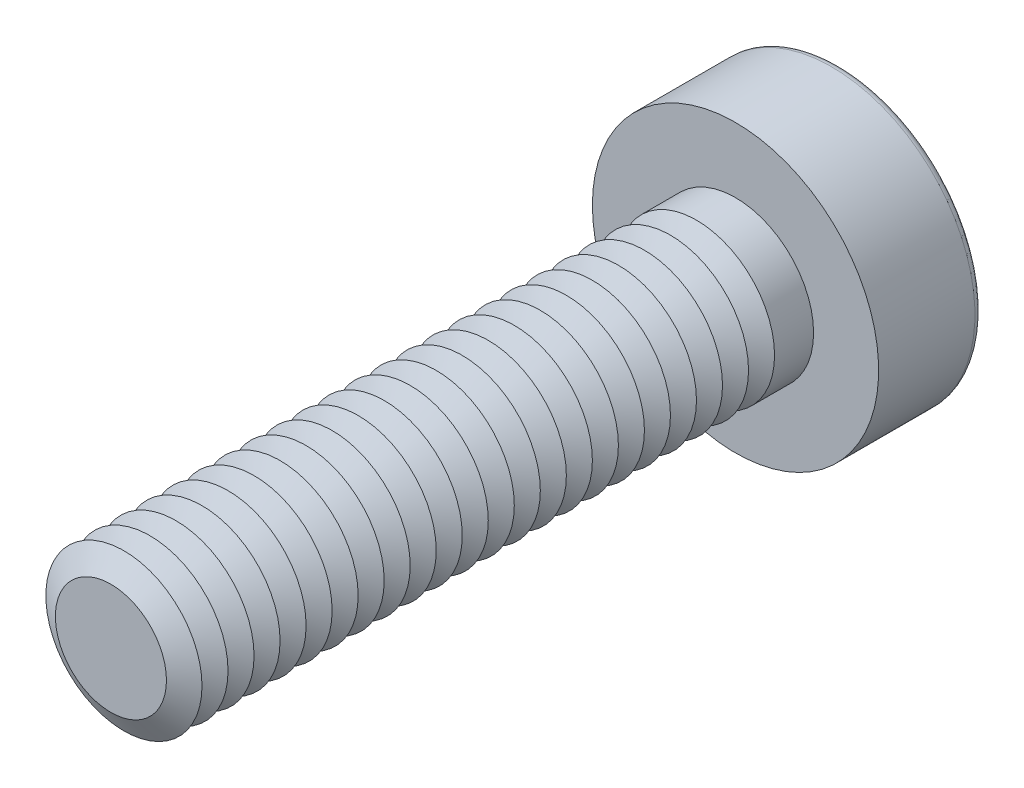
ISO-10303-21;
HEADER;
FILE_DESCRIPTION(('STEP AP214'),'2;1');
FILE_NAME('part.step','',(''),(''),'','','');
FILE_SCHEMA(('AUTOMOTIVE_DESIGN { 1 0 10303 214 1 1 1 1 }'));
ENDSEC;
DATA;
#1=APPLICATION_CONTEXT('core data for automotive mechanical design processes');
#2=APPLICATION_PROTOCOL_DEFINITION('international standard','automotive_design',2000,#1);
#3=PRODUCT_CONTEXT('',#1,'mechanical');
#4=PRODUCT('Part','Part','',(#3));
#5=PRODUCT_RELATED_PRODUCT_CATEGORY('part','',(#4));
#6=PRODUCT_DEFINITION_FORMATION('','',#4);
#7=PRODUCT_DEFINITION_CONTEXT('part definition',#1,'design');
#8=PRODUCT_DEFINITION('design','',#6,#7);
#9=PRODUCT_DEFINITION_SHAPE('','',#8);
#10=(LENGTH_UNIT() NAMED_UNIT(*) SI_UNIT(.MILLI.,.METRE.));
#11=(NAMED_UNIT(*) PLANE_ANGLE_UNIT() SI_UNIT($,.RADIAN.));
#12=(NAMED_UNIT(*) SI_UNIT($,.STERADIAN.) SOLID_ANGLE_UNIT());
#13=UNCERTAINTY_MEASURE_WITH_UNIT(LENGTH_MEASURE(1.E-05),#10,'distance_accuracy_value','');
#14=(GEOMETRIC_REPRESENTATION_CONTEXT(3) GLOBAL_UNCERTAINTY_ASSIGNED_CONTEXT((#13)) GLOBAL_UNIT_ASSIGNED_CONTEXT((#10,
#11,#12)) REPRESENTATION_CONTEXT('',''));
#15=CARTESIAN_POINT('',(0.,0.,0.));
#16=DIRECTION('',(0.,0.,1.));
#17=DIRECTION('',(1.,0.,0.));
#18=AXIS2_PLACEMENT_3D('',#15,#16,#17);
#19=CARTESIAN_POINT('',(0.,0.,10.25));
#20=DIRECTION('',(0.,0.,1.));
#21=DIRECTION('',(1.,0.,0.));
#22=AXIS2_PLACEMENT_3D('',#19,#20,#21);
#23=CONICAL_SURFACE('',#22,1.5,1.0471975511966);
#24=CARTESIAN_POINT('',(0.,0.,10.));
#25=DIRECTION('',(0.,0.,1.));
#26=DIRECTION('',(1.,0.,0.));
#27=AXIS2_PLACEMENT_3D('',#24,#25,#26);
#28=CIRCLE('',#27,1.06698729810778);
#29=CARTESIAN_POINT('',(1.06698729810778,0.,10.));
#30=VERTEX_POINT('',#29);
#31=EDGE_CURVE('E313',#30,#30,#28,.T.);
#32=ORIENTED_EDGE('',*,*,#31,.T.);
#33=EDGE_LOOP('',(#32));
#34=FACE_BOUND('',#33,.T.);
#35=CARTESIAN_POINT('',(0.,0.,10.25));
#36=DIRECTION('',(0.,0.,1.));
#37=DIRECTION('',(1.,0.,0.));
#38=AXIS2_PLACEMENT_3D('',#35,#36,#37);
#39=CIRCLE('',#38,1.5);
#40=CARTESIAN_POINT('',(1.5,0.,10.25));
#41=VERTEX_POINT('',#40);
#42=EDGE_CURVE('E316',#41,#41,#39,.T.);
#43=ORIENTED_EDGE('',*,*,#42,.F.);
#44=EDGE_LOOP('',(#43));
#45=FACE_BOUND('',#44,.T.);
#46=ADVANCED_FACE('F39',(#34,#45),#23,.T.);
#47=CARTESIAN_POINT('',(0.,0.,10.));
#48=DIRECTION('',(0.,0.,-1.));
#49=DIRECTION('',(-1.,0.,0.));
#50=AXIS2_PLACEMENT_3D('',#47,#48,#49);
#51=CONICAL_SURFACE('',#50,1.06698729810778,1.0471975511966);
#52=CARTESIAN_POINT('',(0.,0.,9.75));
#53=DIRECTION('',(0.,0.,1.));
#54=DIRECTION('',(1.,0.,0.));
#55=AXIS2_PLACEMENT_3D('',#52,#53,#54);
#56=CIRCLE('',#55,1.5);
#57=CARTESIAN_POINT('',(1.5,0.,9.75));
#58=VERTEX_POINT('',#57);
#59=EDGE_CURVE('E323',#58,#58,#56,.T.);
#60=ORIENTED_EDGE('',*,*,#59,.T.);
#61=EDGE_LOOP('',(#60));
#62=FACE_BOUND('',#61,.T.);
#63=ORIENTED_EDGE('',*,*,#31,.F.);
#64=EDGE_LOOP('',(#63));
#65=FACE_BOUND('',#64,.T.);
#66=ADVANCED_FACE('F244',(#62,#65),#51,.T.);
#67=CARTESIAN_POINT('',(0.,0.,12.));
#68=DIRECTION('',(0.,0.,1.));
#69=DIRECTION('',(1.,0.,0.));
#70=AXIS2_PLACEMENT_3D('',#67,#68,#69);
#71=PLANE('',#70);
#72=CARTESIAN_POINT('',(0.,0.,12.));
#73=DIRECTION('',(0.,0.,1.));
#74=DIRECTION('',(1.,0.,0.));
#75=AXIS2_PLACEMENT_3D('',#72,#73,#74);
#76=CIRCLE('',#75,1.06698729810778);
#77=CARTESIAN_POINT('',(1.06698729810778,0.,12.));
#78=VERTEX_POINT('',#77);
#79=EDGE_CURVE('E174',#78,#78,#76,.T.);
#80=ORIENTED_EDGE('',*,*,#79,.T.);
#81=EDGE_LOOP('',(#80));
#82=FACE_BOUND('',#81,.T.);
#83=ADVANCED_FACE('F250',(#82),#71,.T.);
#84=CARTESIAN_POINT('',(0.,0.,12.));
#85=DIRECTION('',(0.,0.,-1.));
#86=DIRECTION('',(-1.,0.,0.));
#87=AXIS2_PLACEMENT_3D('',#84,#85,#86);
#88=CONICAL_SURFACE('',#87,1.06698729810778,1.0471975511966);
#89=CARTESIAN_POINT('',(0.,0.,11.75));
#90=DIRECTION('',(0.,0.,1.));
#91=DIRECTION('',(1.,0.,0.));
#92=AXIS2_PLACEMENT_3D('',#89,#90,#91);
#93=CIRCLE('',#92,1.5);
#94=CARTESIAN_POINT('',(1.5,0.,11.75));
#95=VERTEX_POINT('',#94);
#96=EDGE_CURVE('E290',#95,#95,#93,.T.);
#97=ORIENTED_EDGE('',*,*,#96,.T.);
#98=EDGE_LOOP('',(#97));
#99=FACE_BOUND('',#98,.T.);
#100=ORIENTED_EDGE('',*,*,#79,.F.);
#101=EDGE_LOOP('',(#100));
#102=FACE_BOUND('',#101,.T.);
#103=ADVANCED_FACE('F199',(#99,#102),#88,.T.);
#104=CARTESIAN_POINT('',(0.,0.,11.75));
#105=DIRECTION('',(0.,0.,1.));
#106=DIRECTION('',(1.,0.,0.));
#107=AXIS2_PLACEMENT_3D('',#104,#105,#106);
#108=CONICAL_SURFACE('',#107,1.5,1.0471975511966);
#109=CARTESIAN_POINT('',(0.,0.,11.5));
#110=DIRECTION('',(0.,0.,1.));
#111=DIRECTION('',(1.,0.,0.));
#112=AXIS2_PLACEMENT_3D('',#109,#110,#111);
#113=CIRCLE('',#112,1.06698729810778);
#114=CARTESIAN_POINT('',(1.06698729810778,0.,11.5));
#115=VERTEX_POINT('',#114);
#116=EDGE_CURVE('E287',#115,#115,#113,.T.);
#117=ORIENTED_EDGE('',*,*,#116,.T.);
#118=EDGE_LOOP('',(#117));
#119=FACE_BOUND('',#118,.T.);
#120=ORIENTED_EDGE('',*,*,#96,.F.);
#121=EDGE_LOOP('',(#120));
#122=FACE_BOUND('',#121,.T.);
#123=ADVANCED_FACE('F276',(#119,#122),#108,.T.);
#124=CARTESIAN_POINT('',(0.,0.,11.5));
#125=DIRECTION('',(0.,0.,-1.));
#126=DIRECTION('',(-1.,0.,0.));
#127=AXIS2_PLACEMENT_3D('',#124,#125,#126);
#128=CONICAL_SURFACE('',#127,1.06698729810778,1.0471975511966);
#129=CARTESIAN_POINT('',(0.,0.,11.25));
#130=DIRECTION('',(0.,0.,1.));
#131=DIRECTION('',(1.,0.,0.));
#132=AXIS2_PLACEMENT_3D('',#129,#130,#131);
#133=CIRCLE('',#132,1.5);
#134=CARTESIAN_POINT('',(1.5,0.,11.25));
#135=VERTEX_POINT('',#134);
#136=EDGE_CURVE('E299',#135,#135,#133,.T.);
#137=ORIENTED_EDGE('',*,*,#136,.T.);
#138=EDGE_LOOP('',(#137));
#139=FACE_BOUND('',#138,.T.);
#140=ORIENTED_EDGE('',*,*,#116,.F.);
#141=EDGE_LOOP('',(#140));
#142=FACE_BOUND('',#141,.T.);
#143=ADVANCED_FACE('F273',(#139,#142),#128,.T.);
#144=CARTESIAN_POINT('',(0.,0.,11.25));
#145=DIRECTION('',(0.,0.,1.));
#146=DIRECTION('',(1.,0.,0.));
#147=AXIS2_PLACEMENT_3D('',#144,#145,#146);
#148=CONICAL_SURFACE('',#147,1.5,1.0471975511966);
#149=CARTESIAN_POINT('',(0.,0.,11.));
#150=DIRECTION('',(0.,0.,1.));
#151=DIRECTION('',(1.,0.,0.));
#152=AXIS2_PLACEMENT_3D('',#149,#150,#151);
#153=CIRCLE('',#152,1.06698729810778);
#154=CARTESIAN_POINT('',(1.06698729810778,0.,11.));
#155=VERTEX_POINT('',#154);
#156=EDGE_CURVE('E292',#155,#155,#153,.T.);
#157=ORIENTED_EDGE('',*,*,#156,.T.);
#158=EDGE_LOOP('',(#157));
#159=FACE_BOUND('',#158,.T.);
#160=ORIENTED_EDGE('',*,*,#136,.F.);
#161=EDGE_LOOP('',(#160));
#162=FACE_BOUND('',#161,.T.);
#163=ADVANCED_FACE('F269',(#159,#162),#148,.T.);
#164=CARTESIAN_POINT('',(0.,0.,11.));
#165=DIRECTION('',(0.,0.,-1.));
#166=DIRECTION('',(-1.,0.,0.));
#167=AXIS2_PLACEMENT_3D('',#164,#165,#166);
#168=CONICAL_SURFACE('',#167,1.06698729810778,1.0471975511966);
#169=CARTESIAN_POINT('',(0.,0.,10.75));
#170=DIRECTION('',(0.,0.,1.));
#171=DIRECTION('',(1.,0.,0.));
#172=AXIS2_PLACEMENT_3D('',#169,#170,#171);
#173=CIRCLE('',#172,1.5);
#174=CARTESIAN_POINT('',(1.5,0.,10.75));
#175=VERTEX_POINT('',#174);
#176=EDGE_CURVE('E309',#175,#175,#173,.T.);
#177=ORIENTED_EDGE('',*,*,#176,.T.);
#178=EDGE_LOOP('',(#177));
#179=FACE_BOUND('',#178,.T.);
#180=ORIENTED_EDGE('',*,*,#156,.F.);
#181=EDGE_LOOP('',(#180));
#182=FACE_BOUND('',#181,.T.);
#183=ADVANCED_FACE('F265',(#179,#182),#168,.T.);
#184=CARTESIAN_POINT('',(0.,0.,10.75));
#185=DIRECTION('',(0.,0.,1.));
#186=DIRECTION('',(1.,0.,0.));
#187=AXIS2_PLACEMENT_3D('',#184,#185,#186);
#188=CONICAL_SURFACE('',#187,1.5,1.0471975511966);
#189=CARTESIAN_POINT('',(0.,0.,10.5));
#190=DIRECTION('',(0.,0.,1.));
#191=DIRECTION('',(1.,0.,0.));
#192=AXIS2_PLACEMENT_3D('',#189,#190,#191);
#193=CIRCLE('',#192,1.06698729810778);
#194=CARTESIAN_POINT('',(1.06698729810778,0.,10.5));
#195=VERTEX_POINT('',#194);
#196=EDGE_CURVE('E305',#195,#195,#193,.T.);
#197=ORIENTED_EDGE('',*,*,#196,.T.);
#198=EDGE_LOOP('',(#197));
#199=FACE_BOUND('',#198,.T.);
#200=ORIENTED_EDGE('',*,*,#176,.F.);
#201=EDGE_LOOP('',(#200));
#202=FACE_BOUND('',#201,.T.);
#203=ADVANCED_FACE('F261',(#199,#202),#188,.T.);
#204=CARTESIAN_POINT('',(0.,0.,10.5));
#205=DIRECTION('',(0.,0.,-1.));
#206=DIRECTION('',(-1.,0.,0.));
#207=AXIS2_PLACEMENT_3D('',#204,#205,#206);
#208=CONICAL_SURFACE('',#207,1.06698729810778,1.0471975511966);
#209=ORIENTED_EDGE('',*,*,#42,.T.);
#210=EDGE_LOOP('',(#209));
#211=FACE_BOUND('',#210,.T.);
#212=ORIENTED_EDGE('',*,*,#196,.F.);
#213=EDGE_LOOP('',(#212));
#214=FACE_BOUND('',#213,.T.);
#215=ADVANCED_FACE('F257',(#211,#214),#208,.T.);
#216=CARTESIAN_POINT('',(0.,0.,9.75));
#217=DIRECTION('',(0.,0.,1.));
#218=DIRECTION('',(1.,0.,0.));
#219=AXIS2_PLACEMENT_3D('',#216,#217,#218);
#220=CONICAL_SURFACE('',#219,1.5,1.0471975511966);
#221=CARTESIAN_POINT('',(0.,0.,9.5));
#222=DIRECTION('',(0.,0.,1.));
#223=DIRECTION('',(1.,0.,0.));
#224=AXIS2_PLACEMENT_3D('',#221,#222,#223);
#225=CIRCLE('',#224,1.06698729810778);
#226=CARTESIAN_POINT('',(1.06698729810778,0.,9.5));
#227=VERTEX_POINT('',#226);
#228=EDGE_CURVE('E319',#227,#227,#225,.T.);
#229=ORIENTED_EDGE('',*,*,#228,.T.);
#230=EDGE_LOOP('',(#229));
#231=FACE_BOUND('',#230,.T.);
#232=ORIENTED_EDGE('',*,*,#59,.F.);
#233=EDGE_LOOP('',(#232));
#234=FACE_BOUND('',#233,.T.);
#235=ADVANCED_FACE('F260',(#231,#234),#220,.T.);
#236=CARTESIAN_POINT('',(0.,0.,9.5));
#237=DIRECTION('',(0.,0.,-1.));
#238=DIRECTION('',(-1.,0.,0.));
#239=AXIS2_PLACEMENT_3D('',#236,#237,#238);
#240=CONICAL_SURFACE('',#239,1.06698729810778,1.0471975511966);
#241=CARTESIAN_POINT('',(0.,0.,9.25));
#242=DIRECTION('',(0.,0.,1.));
#243=DIRECTION('',(1.,0.,0.));
#244=AXIS2_PLACEMENT_3D('',#241,#242,#243);
#245=CIRCLE('',#244,1.5);
#246=CARTESIAN_POINT('',(1.5,0.,9.25));
#247=VERTEX_POINT('',#246);
#248=EDGE_CURVE('E330',#247,#247,#245,.T.);
#249=ORIENTED_EDGE('',*,*,#248,.T.);
#250=EDGE_LOOP('',(#249));
#251=FACE_BOUND('',#250,.T.);
#252=ORIENTED_EDGE('',*,*,#228,.F.);
#253=EDGE_LOOP('',(#252));
#254=FACE_BOUND('',#253,.T.);
#255=ADVANCED_FACE('F607',(#251,#254),#240,.T.);
#256=CARTESIAN_POINT('',(0.,0.,9.25));
#257=DIRECTION('',(0.,0.,1.));
#258=DIRECTION('',(1.,0.,0.));
#259=AXIS2_PLACEMENT_3D('',#256,#257,#258);
#260=CONICAL_SURFACE('',#259,1.5,1.0471975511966);
#261=CARTESIAN_POINT('',(0.,0.,9.));
#262=DIRECTION('',(0.,0.,1.));
#263=DIRECTION('',(1.,0.,0.));
#264=AXIS2_PLACEMENT_3D('',#261,#262,#263);
#265=CIRCLE('',#264,1.06698729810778);
#266=CARTESIAN_POINT('',(1.06698729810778,0.,9.));
#267=VERTEX_POINT('',#266);
#268=EDGE_CURVE('E327',#267,#267,#265,.T.);
#269=ORIENTED_EDGE('',*,*,#268,.T.);
#270=EDGE_LOOP('',(#269));
#271=FACE_BOUND('',#270,.T.);
#272=ORIENTED_EDGE('',*,*,#248,.F.);
#273=EDGE_LOOP('',(#272));
#274=FACE_BOUND('',#273,.T.);
#275=ADVANCED_FACE('F603',(#271,#274),#260,.T.);
#276=CARTESIAN_POINT('',(0.,0.,9.));
#277=DIRECTION('',(0.,0.,-1.));
#278=DIRECTION('',(-1.,0.,0.));
#279=AXIS2_PLACEMENT_3D('',#276,#277,#278);
#280=CONICAL_SURFACE('',#279,1.06698729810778,1.0471975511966);
#281=CARTESIAN_POINT('',(0.,0.,8.75));
#282=DIRECTION('',(0.,0.,1.));
#283=DIRECTION('',(1.,0.,0.));
#284=AXIS2_PLACEMENT_3D('',#281,#282,#283);
#285=CIRCLE('',#284,1.5);
#286=CARTESIAN_POINT('',(1.5,0.,8.75));
#287=VERTEX_POINT('',#286);
#288=EDGE_CURVE('E338',#287,#287,#285,.T.);
#289=ORIENTED_EDGE('',*,*,#288,.T.);
#290=EDGE_LOOP('',(#289));
#291=FACE_BOUND('',#290,.T.);
#292=ORIENTED_EDGE('',*,*,#268,.F.);
#293=EDGE_LOOP('',(#292));
#294=FACE_BOUND('',#293,.T.);
#295=ADVANCED_FACE('F599',(#291,#294),#280,.T.);
#296=CARTESIAN_POINT('',(0.,0.,8.75));
#297=DIRECTION('',(0.,0.,1.));
#298=DIRECTION('',(1.,0.,0.));
#299=AXIS2_PLACEMENT_3D('',#296,#297,#298);
#300=CONICAL_SURFACE('',#299,1.5,1.0471975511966);
#301=CARTESIAN_POINT('',(0.,0.,8.5));
#302=DIRECTION('',(0.,0.,1.));
#303=DIRECTION('',(1.,0.,0.));
#304=AXIS2_PLACEMENT_3D('',#301,#302,#303);
#305=CIRCLE('',#304,1.06698729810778);
#306=CARTESIAN_POINT('',(1.06698729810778,0.,8.5));
#307=VERTEX_POINT('',#306);
#308=EDGE_CURVE('E334',#307,#307,#305,.T.);
#309=ORIENTED_EDGE('',*,*,#308,.T.);
#310=EDGE_LOOP('',(#309));
#311=FACE_BOUND('',#310,.T.);
#312=ORIENTED_EDGE('',*,*,#288,.F.);
#313=EDGE_LOOP('',(#312));
#314=FACE_BOUND('',#313,.T.);
#315=ADVANCED_FACE('F595',(#311,#314),#300,.T.);
#316=CARTESIAN_POINT('',(0.,0.,8.5));
#317=DIRECTION('',(0.,0.,-1.));
#318=DIRECTION('',(-1.,0.,0.));
#319=AXIS2_PLACEMENT_3D('',#316,#317,#318);
#320=CONICAL_SURFACE('',#319,1.06698729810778,1.0471975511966);
#321=CARTESIAN_POINT('',(0.,0.,8.25));
#322=DIRECTION('',(0.,0.,1.));
#323=DIRECTION('',(1.,0.,0.));
#324=AXIS2_PLACEMENT_3D('',#321,#322,#323);
#325=CIRCLE('',#324,1.5);
#326=CARTESIAN_POINT('',(1.5,0.,8.25));
#327=VERTEX_POINT('',#326);
#328=EDGE_CURVE('E346',#327,#327,#325,.T.);
#329=ORIENTED_EDGE('',*,*,#328,.T.);
#330=EDGE_LOOP('',(#329));
#331=FACE_BOUND('',#330,.T.);
#332=ORIENTED_EDGE('',*,*,#308,.F.);
#333=EDGE_LOOP('',(#332));
#334=FACE_BOUND('',#333,.T.);
#335=ADVANCED_FACE('F591',(#331,#334),#320,.T.);
#336=CARTESIAN_POINT('',(0.,0.,8.25));
#337=DIRECTION('',(0.,0.,1.));
#338=DIRECTION('',(1.,0.,0.));
#339=AXIS2_PLACEMENT_3D('',#336,#337,#338);
#340=CONICAL_SURFACE('',#339,1.5,1.0471975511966);
#341=CARTESIAN_POINT('',(0.,0.,8.));
#342=DIRECTION('',(0.,0.,1.));
#343=DIRECTION('',(1.,0.,0.));
#344=AXIS2_PLACEMENT_3D('',#341,#342,#343);
#345=CIRCLE('',#344,1.06698729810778);
#346=CARTESIAN_POINT('',(1.06698729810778,0.,8.));
#347=VERTEX_POINT('',#346);
#348=EDGE_CURVE('E342',#347,#347,#345,.T.);
#349=ORIENTED_EDGE('',*,*,#348,.T.);
#350=EDGE_LOOP('',(#349));
#351=FACE_BOUND('',#350,.T.);
#352=ORIENTED_EDGE('',*,*,#328,.F.);
#353=EDGE_LOOP('',(#352));
#354=FACE_BOUND('',#353,.T.);
#355=ADVANCED_FACE('F587',(#351,#354),#340,.T.);
#356=CARTESIAN_POINT('',(0.,0.,8.));
#357=DIRECTION('',(0.,0.,-1.));
#358=DIRECTION('',(-1.,0.,0.));
#359=AXIS2_PLACEMENT_3D('',#356,#357,#358);
#360=CONICAL_SURFACE('',#359,1.06698729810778,1.0471975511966);
#361=CARTESIAN_POINT('',(0.,0.,7.75));
#362=DIRECTION('',(0.,0.,1.));
#363=DIRECTION('',(1.,0.,0.));
#364=AXIS2_PLACEMENT_3D('',#361,#362,#363);
#365=CIRCLE('',#364,1.5);
#366=CARTESIAN_POINT('',(1.5,0.,7.75));
#367=VERTEX_POINT('',#366);
#368=EDGE_CURVE('E354',#367,#367,#365,.T.);
#369=ORIENTED_EDGE('',*,*,#368,.T.);
#370=EDGE_LOOP('',(#369));
#371=FACE_BOUND('',#370,.T.);
#372=ORIENTED_EDGE('',*,*,#348,.F.);
#373=EDGE_LOOP('',(#372));
#374=FACE_BOUND('',#373,.T.);
#375=ADVANCED_FACE('F583',(#371,#374),#360,.T.);
#376=CARTESIAN_POINT('',(0.,0.,7.75));
#377=DIRECTION('',(0.,0.,1.));
#378=DIRECTION('',(1.,0.,0.));
#379=AXIS2_PLACEMENT_3D('',#376,#377,#378);
#380=CONICAL_SURFACE('',#379,1.5,1.0471975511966);
#381=CARTESIAN_POINT('',(0.,0.,7.5));
#382=DIRECTION('',(0.,0.,1.));
#383=DIRECTION('',(1.,0.,0.));
#384=AXIS2_PLACEMENT_3D('',#381,#382,#383);
#385=CIRCLE('',#384,1.06698729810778);
#386=CARTESIAN_POINT('',(1.06698729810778,0.,7.5));
#387=VERTEX_POINT('',#386);
#388=EDGE_CURVE('E350',#387,#387,#385,.T.);
#389=ORIENTED_EDGE('',*,*,#388,.T.);
#390=EDGE_LOOP('',(#389));
#391=FACE_BOUND('',#390,.T.);
#392=ORIENTED_EDGE('',*,*,#368,.F.);
#393=EDGE_LOOP('',(#392));
#394=FACE_BOUND('',#393,.T.);
#395=ADVANCED_FACE('F579',(#391,#394),#380,.T.);
#396=CARTESIAN_POINT('',(0.,0.,7.5));
#397=DIRECTION('',(0.,0.,-1.));
#398=DIRECTION('',(-1.,0.,0.));
#399=AXIS2_PLACEMENT_3D('',#396,#397,#398);
#400=CONICAL_SURFACE('',#399,1.06698729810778,1.0471975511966);
#401=CARTESIAN_POINT('',(0.,0.,7.25));
#402=DIRECTION('',(0.,0.,1.));
#403=DIRECTION('',(1.,0.,0.));
#404=AXIS2_PLACEMENT_3D('',#401,#402,#403);
#405=CIRCLE('',#404,1.5);
#406=CARTESIAN_POINT('',(1.5,0.,7.25));
#407=VERTEX_POINT('',#406);
#408=EDGE_CURVE('E362',#407,#407,#405,.T.);
#409=ORIENTED_EDGE('',*,*,#408,.T.);
#410=EDGE_LOOP('',(#409));
#411=FACE_BOUND('',#410,.T.);
#412=ORIENTED_EDGE('',*,*,#388,.F.);
#413=EDGE_LOOP('',(#412));
#414=FACE_BOUND('',#413,.T.);
#415=ADVANCED_FACE('F575',(#411,#414),#400,.T.);
#416=CARTESIAN_POINT('',(0.,0.,7.25));
#417=DIRECTION('',(0.,0.,1.));
#418=DIRECTION('',(1.,0.,0.));
#419=AXIS2_PLACEMENT_3D('',#416,#417,#418);
#420=CONICAL_SURFACE('',#419,1.5,1.0471975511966);
#421=CARTESIAN_POINT('',(0.,0.,7.));
#422=DIRECTION('',(0.,0.,1.));
#423=DIRECTION('',(1.,0.,0.));
#424=AXIS2_PLACEMENT_3D('',#421,#422,#423);
#425=CIRCLE('',#424,1.06698729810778);
#426=CARTESIAN_POINT('',(1.06698729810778,0.,7.));
#427=VERTEX_POINT('',#426);
#428=EDGE_CURVE('E358',#427,#427,#425,.T.);
#429=ORIENTED_EDGE('',*,*,#428,.T.);
#430=EDGE_LOOP('',(#429));
#431=FACE_BOUND('',#430,.T.);
#432=ORIENTED_EDGE('',*,*,#408,.F.);
#433=EDGE_LOOP('',(#432));
#434=FACE_BOUND('',#433,.T.);
#435=ADVANCED_FACE('F571',(#431,#434),#420,.T.);
#436=CARTESIAN_POINT('',(0.,0.,7.));
#437=DIRECTION('',(0.,0.,-1.));
#438=DIRECTION('',(-1.,0.,0.));
#439=AXIS2_PLACEMENT_3D('',#436,#437,#438);
#440=CONICAL_SURFACE('',#439,1.06698729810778,1.0471975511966);
#441=CARTESIAN_POINT('',(0.,0.,6.75));
#442=DIRECTION('',(0.,0.,1.));
#443=DIRECTION('',(1.,0.,0.));
#444=AXIS2_PLACEMENT_3D('',#441,#442,#443);
#445=CIRCLE('',#444,1.5);
#446=CARTESIAN_POINT('',(1.5,0.,6.75));
#447=VERTEX_POINT('',#446);
#448=EDGE_CURVE('E370',#447,#447,#445,.T.);
#449=ORIENTED_EDGE('',*,*,#448,.T.);
#450=EDGE_LOOP('',(#449));
#451=FACE_BOUND('',#450,.T.);
#452=ORIENTED_EDGE('',*,*,#428,.F.);
#453=EDGE_LOOP('',(#452));
#454=FACE_BOUND('',#453,.T.);
#455=ADVANCED_FACE('F567',(#451,#454),#440,.T.);
#456=CARTESIAN_POINT('',(0.,0.,6.75));
#457=DIRECTION('',(0.,0.,1.));
#458=DIRECTION('',(1.,0.,0.));
#459=AXIS2_PLACEMENT_3D('',#456,#457,#458);
#460=CONICAL_SURFACE('',#459,1.5,1.0471975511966);
#461=CARTESIAN_POINT('',(0.,0.,6.5));
#462=DIRECTION('',(0.,0.,1.));
#463=DIRECTION('',(1.,0.,0.));
#464=AXIS2_PLACEMENT_3D('',#461,#462,#463);
#465=CIRCLE('',#464,1.06698729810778);
#466=CARTESIAN_POINT('',(1.06698729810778,0.,6.5));
#467=VERTEX_POINT('',#466);
#468=EDGE_CURVE('E366',#467,#467,#465,.T.);
#469=ORIENTED_EDGE('',*,*,#468,.T.);
#470=EDGE_LOOP('',(#469));
#471=FACE_BOUND('',#470,.T.);
#472=ORIENTED_EDGE('',*,*,#448,.F.);
#473=EDGE_LOOP('',(#472));
#474=FACE_BOUND('',#473,.T.);
#475=ADVANCED_FACE('F563',(#471,#474),#460,.T.);
#476=CARTESIAN_POINT('',(0.,0.,6.5));
#477=DIRECTION('',(0.,0.,-1.));
#478=DIRECTION('',(-1.,0.,0.));
#479=AXIS2_PLACEMENT_3D('',#476,#477,#478);
#480=CONICAL_SURFACE('',#479,1.06698729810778,1.0471975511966);
#481=CARTESIAN_POINT('',(0.,0.,6.25));
#482=DIRECTION('',(0.,0.,1.));
#483=DIRECTION('',(1.,0.,0.));
#484=AXIS2_PLACEMENT_3D('',#481,#482,#483);
#485=CIRCLE('',#484,1.5);
#486=CARTESIAN_POINT('',(1.5,0.,6.25));
#487=VERTEX_POINT('',#486);
#488=EDGE_CURVE('E378',#487,#487,#485,.T.);
#489=ORIENTED_EDGE('',*,*,#488,.T.);
#490=EDGE_LOOP('',(#489));
#491=FACE_BOUND('',#490,.T.);
#492=ORIENTED_EDGE('',*,*,#468,.F.);
#493=EDGE_LOOP('',(#492));
#494=FACE_BOUND('',#493,.T.);
#495=ADVANCED_FACE('F559',(#491,#494),#480,.T.);
#496=CARTESIAN_POINT('',(0.,0.,6.25));
#497=DIRECTION('',(0.,0.,1.));
#498=DIRECTION('',(1.,0.,0.));
#499=AXIS2_PLACEMENT_3D('',#496,#497,#498);
#500=CONICAL_SURFACE('',#499,1.5,1.0471975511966);
#501=CARTESIAN_POINT('',(0.,0.,6.));
#502=DIRECTION('',(0.,0.,1.));
#503=DIRECTION('',(1.,0.,0.));
#504=AXIS2_PLACEMENT_3D('',#501,#502,#503);
#505=CIRCLE('',#504,1.06698729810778);
#506=CARTESIAN_POINT('',(1.06698729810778,0.,6.));
#507=VERTEX_POINT('',#506);
#508=EDGE_CURVE('E374',#507,#507,#505,.T.);
#509=ORIENTED_EDGE('',*,*,#508,.T.);
#510=EDGE_LOOP('',(#509));
#511=FACE_BOUND('',#510,.T.);
#512=ORIENTED_EDGE('',*,*,#488,.F.);
#513=EDGE_LOOP('',(#512));
#514=FACE_BOUND('',#513,.T.);
#515=ADVANCED_FACE('F555',(#511,#514),#500,.T.);
#516=CARTESIAN_POINT('',(0.,0.,6.));
#517=DIRECTION('',(0.,0.,-1.));
#518=DIRECTION('',(-1.,0.,0.));
#519=AXIS2_PLACEMENT_3D('',#516,#517,#518);
#520=CONICAL_SURFACE('',#519,1.06698729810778,1.0471975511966);
#521=CARTESIAN_POINT('',(0.,0.,5.75));
#522=DIRECTION('',(0.,0.,1.));
#523=DIRECTION('',(1.,0.,0.));
#524=AXIS2_PLACEMENT_3D('',#521,#522,#523);
#525=CIRCLE('',#524,1.5);
#526=CARTESIAN_POINT('',(1.5,0.,5.75));
#527=VERTEX_POINT('',#526);
#528=EDGE_CURVE('E386',#527,#527,#525,.T.);
#529=ORIENTED_EDGE('',*,*,#528,.T.);
#530=EDGE_LOOP('',(#529));
#531=FACE_BOUND('',#530,.T.);
#532=ORIENTED_EDGE('',*,*,#508,.F.);
#533=EDGE_LOOP('',(#532));
#534=FACE_BOUND('',#533,.T.);
#535=ADVANCED_FACE('F551',(#531,#534),#520,.T.);
#536=CARTESIAN_POINT('',(0.,0.,5.75));
#537=DIRECTION('',(0.,0.,1.));
#538=DIRECTION('',(1.,0.,0.));
#539=AXIS2_PLACEMENT_3D('',#536,#537,#538);
#540=CONICAL_SURFACE('',#539,1.5,1.0471975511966);
#541=CARTESIAN_POINT('',(0.,0.,5.5));
#542=DIRECTION('',(0.,0.,1.));
#543=DIRECTION('',(1.,0.,0.));
#544=AXIS2_PLACEMENT_3D('',#541,#542,#543);
#545=CIRCLE('',#544,1.06698729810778);
#546=CARTESIAN_POINT('',(1.06698729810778,0.,5.5));
#547=VERTEX_POINT('',#546);
#548=EDGE_CURVE('E382',#547,#547,#545,.T.);
#549=ORIENTED_EDGE('',*,*,#548,.T.);
#550=EDGE_LOOP('',(#549));
#551=FACE_BOUND('',#550,.T.);
#552=ORIENTED_EDGE('',*,*,#528,.F.);
#553=EDGE_LOOP('',(#552));
#554=FACE_BOUND('',#553,.T.);
#555=ADVANCED_FACE('F547',(#551,#554),#540,.T.);
#556=CARTESIAN_POINT('',(0.,0.,5.5));
#557=DIRECTION('',(0.,0.,-1.));
#558=DIRECTION('',(-1.,0.,0.));
#559=AXIS2_PLACEMENT_3D('',#556,#557,#558);
#560=CONICAL_SURFACE('',#559,1.06698729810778,1.0471975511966);
#561=CARTESIAN_POINT('',(0.,0.,5.25));
#562=DIRECTION('',(0.,0.,1.));
#563=DIRECTION('',(1.,0.,0.));
#564=AXIS2_PLACEMENT_3D('',#561,#562,#563);
#565=CIRCLE('',#564,1.5);
#566=CARTESIAN_POINT('',(1.5,0.,5.25));
#567=VERTEX_POINT('',#566);
#568=EDGE_CURVE('E394',#567,#567,#565,.T.);
#569=ORIENTED_EDGE('',*,*,#568,.T.);
#570=EDGE_LOOP('',(#569));
#571=FACE_BOUND('',#570,.T.);
#572=ORIENTED_EDGE('',*,*,#548,.F.);
#573=EDGE_LOOP('',(#572));
#574=FACE_BOUND('',#573,.T.);
#575=ADVANCED_FACE('F543',(#571,#574),#560,.T.);
#576=CARTESIAN_POINT('',(0.,0.,5.25));
#577=DIRECTION('',(0.,0.,1.));
#578=DIRECTION('',(1.,0.,0.));
#579=AXIS2_PLACEMENT_3D('',#576,#577,#578);
#580=CONICAL_SURFACE('',#579,1.5,1.0471975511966);
#581=CARTESIAN_POINT('',(0.,0.,5.));
#582=DIRECTION('',(0.,0.,1.));
#583=DIRECTION('',(1.,0.,0.));
#584=AXIS2_PLACEMENT_3D('',#581,#582,#583);
#585=CIRCLE('',#584,1.06698729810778);
#586=CARTESIAN_POINT('',(1.06698729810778,0.,5.));
#587=VERTEX_POINT('',#586);
#588=EDGE_CURVE('E390',#587,#587,#585,.T.);
#589=ORIENTED_EDGE('',*,*,#588,.T.);
#590=EDGE_LOOP('',(#589));
#591=FACE_BOUND('',#590,.T.);
#592=ORIENTED_EDGE('',*,*,#568,.F.);
#593=EDGE_LOOP('',(#592));
#594=FACE_BOUND('',#593,.T.);
#595=ADVANCED_FACE('F539',(#591,#594),#580,.T.);
#596=CARTESIAN_POINT('',(0.,0.,5.));
#597=DIRECTION('',(0.,0.,-1.));
#598=DIRECTION('',(-1.,0.,0.));
#599=AXIS2_PLACEMENT_3D('',#596,#597,#598);
#600=CONICAL_SURFACE('',#599,1.06698729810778,1.0471975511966);
#601=CARTESIAN_POINT('',(0.,0.,4.75));
#602=DIRECTION('',(0.,0.,1.));
#603=DIRECTION('',(1.,0.,0.));
#604=AXIS2_PLACEMENT_3D('',#601,#602,#603);
#605=CIRCLE('',#604,1.5);
#606=CARTESIAN_POINT('',(1.5,0.,4.75));
#607=VERTEX_POINT('',#606);
#608=EDGE_CURVE('E402',#607,#607,#605,.T.);
#609=ORIENTED_EDGE('',*,*,#608,.T.);
#610=EDGE_LOOP('',(#609));
#611=FACE_BOUND('',#610,.T.);
#612=ORIENTED_EDGE('',*,*,#588,.F.);
#613=EDGE_LOOP('',(#612));
#614=FACE_BOUND('',#613,.T.);
#615=ADVANCED_FACE('F535',(#611,#614),#600,.T.);
#616=CARTESIAN_POINT('',(0.,0.,4.75));
#617=DIRECTION('',(0.,0.,1.));
#618=DIRECTION('',(1.,0.,0.));
#619=AXIS2_PLACEMENT_3D('',#616,#617,#618);
#620=CONICAL_SURFACE('',#619,1.5,1.0471975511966);
#621=CARTESIAN_POINT('',(0.,0.,4.5));
#622=DIRECTION('',(0.,0.,1.));
#623=DIRECTION('',(1.,0.,0.));
#624=AXIS2_PLACEMENT_3D('',#621,#622,#623);
#625=CIRCLE('',#624,1.06698729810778);
#626=CARTESIAN_POINT('',(1.06698729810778,0.,4.5));
#627=VERTEX_POINT('',#626);
#628=EDGE_CURVE('E398',#627,#627,#625,.T.);
#629=ORIENTED_EDGE('',*,*,#628,.T.);
#630=EDGE_LOOP('',(#629));
#631=FACE_BOUND('',#630,.T.);
#632=ORIENTED_EDGE('',*,*,#608,.F.);
#633=EDGE_LOOP('',(#632));
#634=FACE_BOUND('',#633,.T.);
#635=ADVANCED_FACE('F531',(#631,#634),#620,.T.);
#636=CARTESIAN_POINT('',(0.,0.,4.5));
#637=DIRECTION('',(0.,0.,-1.));
#638=DIRECTION('',(-1.,0.,0.));
#639=AXIS2_PLACEMENT_3D('',#636,#637,#638);
#640=CONICAL_SURFACE('',#639,1.06698729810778,1.0471975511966);
#641=CARTESIAN_POINT('',(0.,0.,4.25));
#642=DIRECTION('',(0.,0.,1.));
#643=DIRECTION('',(1.,0.,0.));
#644=AXIS2_PLACEMENT_3D('',#641,#642,#643);
#645=CIRCLE('',#644,1.5);
#646=CARTESIAN_POINT('',(1.5,0.,4.25));
#647=VERTEX_POINT('',#646);
#648=EDGE_CURVE('E410',#647,#647,#645,.T.);
#649=ORIENTED_EDGE('',*,*,#648,.T.);
#650=EDGE_LOOP('',(#649));
#651=FACE_BOUND('',#650,.T.);
#652=ORIENTED_EDGE('',*,*,#628,.F.);
#653=EDGE_LOOP('',(#652));
#654=FACE_BOUND('',#653,.T.);
#655=ADVANCED_FACE('F527',(#651,#654),#640,.T.);
#656=CARTESIAN_POINT('',(0.,0.,4.25));
#657=DIRECTION('',(0.,0.,1.));
#658=DIRECTION('',(1.,0.,0.));
#659=AXIS2_PLACEMENT_3D('',#656,#657,#658);
#660=CONICAL_SURFACE('',#659,1.5,1.0471975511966);
#661=CARTESIAN_POINT('',(0.,0.,4.));
#662=DIRECTION('',(0.,0.,1.));
#663=DIRECTION('',(1.,0.,0.));
#664=AXIS2_PLACEMENT_3D('',#661,#662,#663);
#665=CIRCLE('',#664,1.06698729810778);
#666=CARTESIAN_POINT('',(1.06698729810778,0.,4.));
#667=VERTEX_POINT('',#666);
#668=EDGE_CURVE('E406',#667,#667,#665,.T.);
#669=ORIENTED_EDGE('',*,*,#668,.T.);
#670=EDGE_LOOP('',(#669));
#671=FACE_BOUND('',#670,.T.);
#672=ORIENTED_EDGE('',*,*,#648,.F.);
#673=EDGE_LOOP('',(#672));
#674=FACE_BOUND('',#673,.T.);
#675=ADVANCED_FACE('F523',(#671,#674),#660,.T.);
#676=CARTESIAN_POINT('',(0.,0.,4.));
#677=DIRECTION('',(0.,0.,-1.));
#678=DIRECTION('',(-1.,0.,0.));
#679=AXIS2_PLACEMENT_3D('',#676,#677,#678);
#680=CONICAL_SURFACE('',#679,1.06698729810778,1.0471975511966);
#681=CARTESIAN_POINT('',(0.,0.,3.75));
#682=DIRECTION('',(0.,0.,1.));
#683=DIRECTION('',(1.,0.,0.));
#684=AXIS2_PLACEMENT_3D('',#681,#682,#683);
#685=CIRCLE('',#684,1.5);
#686=CARTESIAN_POINT('',(1.5,0.,3.75));
#687=VERTEX_POINT('',#686);
#688=EDGE_CURVE('E418',#687,#687,#685,.T.);
#689=ORIENTED_EDGE('',*,*,#688,.T.);
#690=EDGE_LOOP('',(#689));
#691=FACE_BOUND('',#690,.T.);
#692=ORIENTED_EDGE('',*,*,#668,.F.);
#693=EDGE_LOOP('',(#692));
#694=FACE_BOUND('',#693,.T.);
#695=ADVANCED_FACE('F519',(#691,#694),#680,.T.);
#696=CARTESIAN_POINT('',(0.,0.,3.75));
#697=DIRECTION('',(0.,0.,1.));
#698=DIRECTION('',(1.,0.,0.));
#699=AXIS2_PLACEMENT_3D('',#696,#697,#698);
#700=CONICAL_SURFACE('',#699,1.5,1.0471975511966);
#701=CARTESIAN_POINT('',(0.,0.,3.5));
#702=DIRECTION('',(0.,0.,1.));
#703=DIRECTION('',(1.,0.,0.));
#704=AXIS2_PLACEMENT_3D('',#701,#702,#703);
#705=CIRCLE('',#704,1.06698729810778);
#706=CARTESIAN_POINT('',(1.06698729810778,0.,3.5));
#707=VERTEX_POINT('',#706);
#708=EDGE_CURVE('E414',#707,#707,#705,.T.);
#709=ORIENTED_EDGE('',*,*,#708,.T.);
#710=EDGE_LOOP('',(#709));
#711=FACE_BOUND('',#710,.T.);
#712=ORIENTED_EDGE('',*,*,#688,.F.);
#713=EDGE_LOOP('',(#712));
#714=FACE_BOUND('',#713,.T.);
#715=ADVANCED_FACE('F515',(#711,#714),#700,.T.);
#716=CARTESIAN_POINT('',(0.,0.,3.5));
#717=DIRECTION('',(0.,0.,-1.));
#718=DIRECTION('',(-1.,0.,0.));
#719=AXIS2_PLACEMENT_3D('',#716,#717,#718);
#720=CONICAL_SURFACE('',#719,1.06698729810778,1.0471975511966);
#721=CARTESIAN_POINT('',(0.,0.,3.25));
#722=DIRECTION('',(0.,0.,1.));
#723=DIRECTION('',(1.,0.,0.));
#724=AXIS2_PLACEMENT_3D('',#721,#722,#723);
#725=CIRCLE('',#724,1.5);
#726=CARTESIAN_POINT('',(1.5,0.,3.25));
#727=VERTEX_POINT('',#726);
#728=EDGE_CURVE('E426',#727,#727,#725,.T.);
#729=ORIENTED_EDGE('',*,*,#728,.T.);
#730=EDGE_LOOP('',(#729));
#731=FACE_BOUND('',#730,.T.);
#732=ORIENTED_EDGE('',*,*,#708,.F.);
#733=EDGE_LOOP('',(#732));
#734=FACE_BOUND('',#733,.T.);
#735=ADVANCED_FACE('F511',(#731,#734),#720,.T.);
#736=CARTESIAN_POINT('',(0.,0.,3.25));
#737=DIRECTION('',(0.,0.,1.));
#738=DIRECTION('',(1.,0.,0.));
#739=AXIS2_PLACEMENT_3D('',#736,#737,#738);
#740=CONICAL_SURFACE('',#739,1.5,1.0471975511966);
#741=CARTESIAN_POINT('',(0.,0.,3.));
#742=DIRECTION('',(0.,0.,1.));
#743=DIRECTION('',(1.,0.,0.));
#744=AXIS2_PLACEMENT_3D('',#741,#742,#743);
#745=CIRCLE('',#744,1.06698729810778);
#746=CARTESIAN_POINT('',(1.06698729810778,0.,3.));
#747=VERTEX_POINT('',#746);
#748=EDGE_CURVE('E422',#747,#747,#745,.T.);
#749=ORIENTED_EDGE('',*,*,#748,.T.);
#750=EDGE_LOOP('',(#749));
#751=FACE_BOUND('',#750,.T.);
#752=ORIENTED_EDGE('',*,*,#728,.F.);
#753=EDGE_LOOP('',(#752));
#754=FACE_BOUND('',#753,.T.);
#755=ADVANCED_FACE('F507',(#751,#754),#740,.T.);
#756=CARTESIAN_POINT('',(0.,0.,3.));
#757=DIRECTION('',(0.,0.,-1.));
#758=DIRECTION('',(-1.,0.,0.));
#759=AXIS2_PLACEMENT_3D('',#756,#757,#758);
#760=CONICAL_SURFACE('',#759,1.06698729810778,1.0471975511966);
#761=CARTESIAN_POINT('',(0.,0.,2.75));
#762=DIRECTION('',(0.,0.,1.));
#763=DIRECTION('',(1.,0.,0.));
#764=AXIS2_PLACEMENT_3D('',#761,#762,#763);
#765=CIRCLE('',#764,1.5);
#766=CARTESIAN_POINT('',(1.5,0.,2.75));
#767=VERTEX_POINT('',#766);
#768=EDGE_CURVE('E434',#767,#767,#765,.T.);
#769=ORIENTED_EDGE('',*,*,#768,.T.);
#770=EDGE_LOOP('',(#769));
#771=FACE_BOUND('',#770,.T.);
#772=ORIENTED_EDGE('',*,*,#748,.F.);
#773=EDGE_LOOP('',(#772));
#774=FACE_BOUND('',#773,.T.);
#775=ADVANCED_FACE('F503',(#771,#774),#760,.T.);
#776=CARTESIAN_POINT('',(0.,0.,2.75));
#777=DIRECTION('',(0.,0.,1.));
#778=DIRECTION('',(1.,0.,0.));
#779=AXIS2_PLACEMENT_3D('',#776,#777,#778);
#780=CONICAL_SURFACE('',#779,1.5,1.0471975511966);
#781=CARTESIAN_POINT('',(0.,0.,2.5));
#782=DIRECTION('',(0.,0.,1.));
#783=DIRECTION('',(1.,0.,0.));
#784=AXIS2_PLACEMENT_3D('',#781,#782,#783);
#785=CIRCLE('',#784,1.06698729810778);
#786=CARTESIAN_POINT('',(1.06698729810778,0.,2.5));
#787=VERTEX_POINT('',#786);
#788=EDGE_CURVE('E430',#787,#787,#785,.T.);
#789=ORIENTED_EDGE('',*,*,#788,.T.);
#790=EDGE_LOOP('',(#789));
#791=FACE_BOUND('',#790,.T.);
#792=ORIENTED_EDGE('',*,*,#768,.F.);
#793=EDGE_LOOP('',(#792));
#794=FACE_BOUND('',#793,.T.);
#795=ADVANCED_FACE('F499',(#791,#794),#780,.T.);
#796=CARTESIAN_POINT('',(0.,0.,2.5));
#797=DIRECTION('',(0.,0.,-1.));
#798=DIRECTION('',(-1.,0.,0.));
#799=AXIS2_PLACEMENT_3D('',#796,#797,#798);
#800=CONICAL_SURFACE('',#799,1.06698729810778,1.0471975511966);
#801=CARTESIAN_POINT('',(0.,0.,2.25));
#802=DIRECTION('',(0.,0.,1.));
#803=DIRECTION('',(1.,0.,0.));
#804=AXIS2_PLACEMENT_3D('',#801,#802,#803);
#805=CIRCLE('',#804,1.5);
#806=CARTESIAN_POINT('',(1.5,0.,2.25));
#807=VERTEX_POINT('',#806);
#808=EDGE_CURVE('E442',#807,#807,#805,.T.);
#809=ORIENTED_EDGE('',*,*,#808,.T.);
#810=EDGE_LOOP('',(#809));
#811=FACE_BOUND('',#810,.T.);
#812=ORIENTED_EDGE('',*,*,#788,.F.);
#813=EDGE_LOOP('',(#812));
#814=FACE_BOUND('',#813,.T.);
#815=ADVANCED_FACE('F495',(#811,#814),#800,.T.);
#816=CARTESIAN_POINT('',(0.,0.,2.25));
#817=DIRECTION('',(0.,0.,1.));
#818=DIRECTION('',(1.,0.,0.));
#819=AXIS2_PLACEMENT_3D('',#816,#817,#818);
#820=CONICAL_SURFACE('',#819,1.5,1.0471975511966);
#821=CARTESIAN_POINT('',(0.,0.,2.));
#822=DIRECTION('',(0.,0.,1.));
#823=DIRECTION('',(1.,0.,0.));
#824=AXIS2_PLACEMENT_3D('',#821,#822,#823);
#825=CIRCLE('',#824,1.06698729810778);
#826=CARTESIAN_POINT('',(1.06698729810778,0.,2.));
#827=VERTEX_POINT('',#826);
#828=EDGE_CURVE('E438',#827,#827,#825,.T.);
#829=ORIENTED_EDGE('',*,*,#828,.T.);
#830=EDGE_LOOP('',(#829));
#831=FACE_BOUND('',#830,.T.);
#832=ORIENTED_EDGE('',*,*,#808,.F.);
#833=EDGE_LOOP('',(#832));
#834=FACE_BOUND('',#833,.T.);
#835=ADVANCED_FACE('F491',(#831,#834),#820,.T.);
#836=CARTESIAN_POINT('',(0.,0.,2.));
#837=DIRECTION('',(0.,0.,-1.));
#838=DIRECTION('',(-1.,0.,0.));
#839=AXIS2_PLACEMENT_3D('',#836,#837,#838);
#840=CONICAL_SURFACE('',#839,1.06698729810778,1.0471975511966);
#841=CARTESIAN_POINT('',(0.,0.,1.75));
#842=DIRECTION('',(0.,0.,1.));
#843=DIRECTION('',(1.,0.,0.));
#844=AXIS2_PLACEMENT_3D('',#841,#842,#843);
#845=CIRCLE('',#844,1.5);
#846=CARTESIAN_POINT('',(1.5,0.,1.75));
#847=VERTEX_POINT('',#846);
#848=EDGE_CURVE('E450',#847,#847,#845,.T.);
#849=ORIENTED_EDGE('',*,*,#848,.T.);
#850=EDGE_LOOP('',(#849));
#851=FACE_BOUND('',#850,.T.);
#852=ORIENTED_EDGE('',*,*,#828,.F.);
#853=EDGE_LOOP('',(#852));
#854=FACE_BOUND('',#853,.T.);
#855=ADVANCED_FACE('F487',(#851,#854),#840,.T.);
#856=CARTESIAN_POINT('',(0.,0.,1.75));
#857=DIRECTION('',(0.,0.,1.));
#858=DIRECTION('',(1.,0.,0.));
#859=AXIS2_PLACEMENT_3D('',#856,#857,#858);
#860=CONICAL_SURFACE('',#859,1.5,1.0471975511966);
#861=CARTESIAN_POINT('',(0.,0.,1.5));
#862=DIRECTION('',(0.,0.,1.));
#863=DIRECTION('',(1.,0.,0.));
#864=AXIS2_PLACEMENT_3D('',#861,#862,#863);
#865=CIRCLE('',#864,1.06698729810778);
#866=CARTESIAN_POINT('',(1.06698729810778,0.,1.5));
#867=VERTEX_POINT('',#866);
#868=EDGE_CURVE('E446',#867,#867,#865,.T.);
#869=ORIENTED_EDGE('',*,*,#868,.T.);
#870=EDGE_LOOP('',(#869));
#871=FACE_BOUND('',#870,.T.);
#872=ORIENTED_EDGE('',*,*,#848,.F.);
#873=EDGE_LOOP('',(#872));
#874=FACE_BOUND('',#873,.T.);
#875=ADVANCED_FACE('F482',(#871,#874),#860,.T.);
#876=CARTESIAN_POINT('',(0.,0.,1.5));
#877=DIRECTION('',(0.,0.,-1.));
#878=DIRECTION('',(-1.,0.,0.));
#879=AXIS2_PLACEMENT_3D('',#876,#877,#878);
#880=CONICAL_SURFACE('',#879,1.06698729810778,1.0471975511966);
#881=CARTESIAN_POINT('',(0.,0.,1.25));
#882=DIRECTION('',(0.,0.,1.));
#883=DIRECTION('',(1.,0.,0.));
#884=AXIS2_PLACEMENT_3D('',#881,#882,#883);
#885=CIRCLE('',#884,1.5);
#886=CARTESIAN_POINT('',(1.5,0.,1.25));
#887=VERTEX_POINT('',#886);
#888=EDGE_CURVE('E462',#887,#887,#885,.T.);
#889=ORIENTED_EDGE('',*,*,#888,.T.);
#890=EDGE_LOOP('',(#889));
#891=FACE_BOUND('',#890,.T.);
#892=ORIENTED_EDGE('',*,*,#868,.F.);
#893=EDGE_LOOP('',(#892));
#894=FACE_BOUND('',#893,.T.);
#895=ADVANCED_FACE('F468',(#891,#894),#880,.T.);
#896=CARTESIAN_POINT('',(0.,0.,1.25));
#897=DIRECTION('',(0.,0.,1.));
#898=DIRECTION('',(1.,0.,0.));
#899=AXIS2_PLACEMENT_3D('',#896,#897,#898);
#900=CONICAL_SURFACE('',#899,1.5,1.0471975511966);
#901=CARTESIAN_POINT('',(0.,0.,1.));
#902=DIRECTION('',(0.,0.,1.));
#903=DIRECTION('',(1.,0.,0.));
#904=AXIS2_PLACEMENT_3D('',#901,#902,#903);
#905=CIRCLE('',#904,1.06698729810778);
#906=CARTESIAN_POINT('',(1.06698729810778,0.,1.));
#907=VERTEX_POINT('',#906);
#908=EDGE_CURVE('E454',#907,#907,#905,.T.);
#909=ORIENTED_EDGE('',*,*,#908,.T.);
#910=EDGE_LOOP('',(#909));
#911=FACE_BOUND('',#910,.T.);
#912=ORIENTED_EDGE('',*,*,#888,.F.);
#913=EDGE_LOOP('',(#912));
#914=FACE_BOUND('',#913,.T.);
#915=ADVANCED_FACE('F471',(#911,#914),#900,.T.);
#916=CARTESIAN_POINT('',(0.,0.,1.));
#917=DIRECTION('',(0.,0.,-1.));
#918=DIRECTION('',(-1.,0.,0.));
#919=AXIS2_PLACEMENT_3D('',#916,#917,#918);
#920=CONICAL_SURFACE('',#919,1.06698729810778,1.0471975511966);
#921=CARTESIAN_POINT('',(0.,0.,0.750000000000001));
#922=DIRECTION('',(0.,0.,1.));
#923=DIRECTION('',(1.,0.,0.));
#924=AXIS2_PLACEMENT_3D('',#921,#922,#923);
#925=CIRCLE('',#924,1.5);
#926=CARTESIAN_POINT('',(1.5,0.,0.750000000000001));
#927=VERTEX_POINT('',#926);
#928=EDGE_CURVE('E458',#927,#927,#925,.T.);
#929=ORIENTED_EDGE('',*,*,#928,.T.);
#930=EDGE_LOOP('',(#929));
#931=FACE_BOUND('',#930,.T.);
#932=ORIENTED_EDGE('',*,*,#908,.F.);
#933=EDGE_LOOP('',(#932));
#934=FACE_BOUND('',#933,.T.);
#935=ADVANCED_FACE('F473',(#931,#934),#920,.T.);
#936=CARTESIAN_POINT('',(0.,0.,-0.5));
#937=DIRECTION('',(0.,0.,-1.));
#938=DIRECTION('',(-1.,0.,0.));
#939=AXIS2_PLACEMENT_3D('',#936,#937,#938);
#940=CONICAL_SURFACE('',#939,0.999999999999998,1.0471975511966);
#941=CARTESIAN_POINT('',(0.,0.,0.0773502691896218));
#942=VERTEX_POINT('',#941);
#943=VERTEX_LOOP('',#942);
#944=FACE_BOUND('',#943,.T.);
#945=CARTESIAN_POINT('',(0.,0.,-0.5));
#946=DIRECTION('',(0.,0.,-1.));
#947=DIRECTION('',(-1.,0.,0.));
#948=AXIS2_PLACEMENT_3D('',#945,#946,#947);
#949=CIRCLE('',#948,0.999999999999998);
#950=CARTESIAN_POINT('',(-0.866025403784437,0.499999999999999,-0.5));
#951=VERTEX_POINT('',#950);
#952=CARTESIAN_POINT('',(0.,0.999999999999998,-0.5));
#953=VERTEX_POINT('',#952);
#954=EDGE_CURVE('E149',#951,#953,#949,.T.);
#955=ORIENTED_EDGE('',*,*,#954,.T.);
#956=CARTESIAN_POINT('',(0.,0.,-0.5));
#957=DIRECTION('',(0.,0.,-1.));
#958=DIRECTION('',(-1.,0.,0.));
#959=AXIS2_PLACEMENT_3D('',#956,#957,#958);
#960=CIRCLE('',#959,0.999999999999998);
#961=CARTESIAN_POINT('',(0.866025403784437,0.499999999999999,-0.5));
#962=VERTEX_POINT('',#961);
#963=EDGE_CURVE('E54',#953,#962,#960,.T.);
#964=ORIENTED_EDGE('',*,*,#963,.T.);
#965=CARTESIAN_POINT('',(0.866025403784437,-0.499999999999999,-0.5));
#966=VERTEX_POINT('',#965);
#967=EDGE_CURVE('E1206',#962,#966,#960,.T.);
#968=ORIENTED_EDGE('',*,*,#967,.T.);
#969=CARTESIAN_POINT('',(0.,-0.999999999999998,-0.5));
#970=VERTEX_POINT('',#969);
#971=EDGE_CURVE('E1204',#966,#970,#960,.T.);
#972=ORIENTED_EDGE('',*,*,#971,.T.);
#973=CARTESIAN_POINT('',(-0.866025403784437,-0.499999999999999,-0.5));
#974=VERTEX_POINT('',#973);
#975=EDGE_CURVE('E1199',#970,#974,#960,.T.);
#976=ORIENTED_EDGE('',*,*,#975,.T.);
#977=EDGE_CURVE('E1197',#974,#951,#960,.T.);
#978=ORIENTED_EDGE('',*,*,#977,.T.);
#979=EDGE_LOOP('',(#955,#964,#968,#972,#976,#978));
#980=FACE_BOUND('',#979,.T.);
#981=ADVANCED_FACE('F201',(#944,#980),#940,.F.);
#982=CARTESIAN_POINT('',(0.,0.,-0.5));
#983=DIRECTION('',(0.,0.,-1.));
#984=DIRECTION('',(-1.,0.,0.));
#985=AXIS2_PLACEMENT_3D('',#982,#983,#984);
#986=PLANE('',#985);
#987=ORIENTED_EDGE('',*,*,#963,.F.);
#988=DIRECTION('',(1.,0.,0.));
#989=VECTOR('',#988,1.);
#990=CARTESIAN_POINT('',(-0.577350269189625,1.,-0.5));
#991=LINE('',#990,#989);
#992=CARTESIAN_POINT('',(0.577350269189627,1.,-0.5));
#993=VERTEX_POINT('',#992);
#994=EDGE_CURVE('E1247',#953,#993,#991,.T.);
#995=ORIENTED_EDGE('',*,*,#994,.T.);
#996=DIRECTION('',(0.5,-0.866025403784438,0.));
#997=VECTOR('',#996,1.);
#998=CARTESIAN_POINT('',(0.577350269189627,1.,-0.5));
#999=LINE('',#998,#997);
#1000=EDGE_CURVE('E155',#993,#962,#999,.T.);
#1001=ORIENTED_EDGE('',*,*,#1000,.T.);
#1002=EDGE_LOOP('',(#987,#995,#1001));
#1003=FACE_BOUND('',#1002,.T.);
#1004=ADVANCED_FACE('F738',(#1003),#986,.T.);
#1005=ORIENTED_EDGE('',*,*,#967,.F.);
#1006=CARTESIAN_POINT('',(1.15470053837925,0.,-0.5));
#1007=VERTEX_POINT('',#1006);
#1008=EDGE_CURVE('E1244',#962,#1007,#999,.T.);
#1009=ORIENTED_EDGE('',*,*,#1008,.T.);
#1010=DIRECTION('',(-0.5,-0.866025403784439,0.));
#1011=VECTOR('',#1010,1.);
#1012=CARTESIAN_POINT('',(1.15470053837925,0.,-0.5));
#1013=LINE('',#1012,#1011);
#1014=EDGE_CURVE('E1220',#1007,#966,#1013,.T.);
#1015=ORIENTED_EDGE('',*,*,#1014,.T.);
#1016=EDGE_LOOP('',(#1005,#1009,#1015));
#1017=FACE_BOUND('',#1016,.T.);
#1018=ADVANCED_FACE('F748',(#1017),#986,.T.);
#1019=ORIENTED_EDGE('',*,*,#971,.F.);
#1020=CARTESIAN_POINT('',(0.577350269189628,-1.,-0.5));
#1021=VERTEX_POINT('',#1020);
#1022=EDGE_CURVE('E1222',#966,#1021,#1013,.T.);
#1023=ORIENTED_EDGE('',*,*,#1022,.T.);
#1024=DIRECTION('',(-1.,0.,0.));
#1025=VECTOR('',#1024,1.);
#1026=CARTESIAN_POINT('',(0.577350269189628,-1.,-0.5));
#1027=LINE('',#1026,#1025);
#1028=EDGE_CURVE('E1171',#1021,#970,#1027,.T.);
#1029=ORIENTED_EDGE('',*,*,#1028,.T.);
#1030=EDGE_LOOP('',(#1019,#1023,#1029));
#1031=FACE_BOUND('',#1030,.T.);
#1032=ADVANCED_FACE('F758',(#1031),#986,.T.);
#1033=ORIENTED_EDGE('',*,*,#975,.F.);
#1034=CARTESIAN_POINT('',(-0.577350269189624,-0.999999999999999,-0.5));
#1035=VERTEX_POINT('',#1034);
#1036=EDGE_CURVE('E1216',#970,#1035,#1027,.T.);
#1037=ORIENTED_EDGE('',*,*,#1036,.T.);
#1038=DIRECTION('',(-0.5,0.866025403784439,0.));
#1039=VECTOR('',#1038,1.);
#1040=CARTESIAN_POINT('',(-0.577350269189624,-0.999999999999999,-0.5));
#1041=LINE('',#1040,#1039);
#1042=EDGE_CURVE('E1218',#1035,#974,#1041,.T.);
#1043=ORIENTED_EDGE('',*,*,#1042,.T.);
#1044=EDGE_LOOP('',(#1033,#1037,#1043));
#1045=FACE_BOUND('',#1044,.T.);
#1046=ADVANCED_FACE('F766',(#1045),#986,.T.);
#1047=ORIENTED_EDGE('',*,*,#977,.F.);
#1048=CARTESIAN_POINT('',(-1.15470053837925,0.,-0.5));
#1049=VERTEX_POINT('',#1048);
#1050=EDGE_CURVE('E1224',#974,#1049,#1041,.T.);
#1051=ORIENTED_EDGE('',*,*,#1050,.T.);
#1052=DIRECTION('',(0.5,0.866025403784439,0.));
#1053=VECTOR('',#1052,1.);
#1054=CARTESIAN_POINT('',(-1.15470053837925,0.,-0.5));
#1055=LINE('',#1054,#1053);
#1056=EDGE_CURVE('E158',#1049,#951,#1055,.T.);
#1057=ORIENTED_EDGE('',*,*,#1056,.T.);
#1058=EDGE_LOOP('',(#1047,#1051,#1057));
#1059=FACE_BOUND('',#1058,.T.);
#1060=ADVANCED_FACE('F230',(#1059),#986,.T.);
#1061=ORIENTED_EDGE('',*,*,#954,.F.);
#1062=CARTESIAN_POINT('',(-0.577350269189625,1.,-0.5));
#1063=VERTEX_POINT('',#1062);
#1064=EDGE_CURVE('E1231',#951,#1063,#1055,.T.);
#1065=ORIENTED_EDGE('',*,*,#1064,.T.);
#1066=EDGE_CURVE('E1245',#1063,#953,#991,.T.);
#1067=ORIENTED_EDGE('',*,*,#1066,.T.);
#1068=EDGE_LOOP('',(#1061,#1065,#1067));
#1069=FACE_BOUND('',#1068,.T.);
#1070=ADVANCED_FACE('F750',(#1069),#986,.T.);
#1071=CARTESIAN_POINT('',(-0.577350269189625,1.,-0.5));
#1072=DIRECTION('',(0.,1.,0.));
#1073=DIRECTION('',(0.,0.,1.));
#1074=AXIS2_PLACEMENT_3D('',#1071,#1072,#1073);
#1075=PLANE('',#1074);
#1076=DIRECTION('',(0.,0.,-1.));
#1077=VECTOR('',#1076,1.);
#1078=CARTESIAN_POINT('',(-0.577350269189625,1.,-0.5));
#1079=LINE('',#1078,#1077);
#1080=CARTESIAN_POINT('',(-0.577350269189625,1.,-2.));
#1081=VERTEX_POINT('',#1080);
#1082=EDGE_CURVE('E147',#1063,#1081,#1079,.T.);
#1083=ORIENTED_EDGE('',*,*,#1082,.T.);
#1084=CARTESIAN_POINT('',(-1.50720379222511,1.,-2.17525844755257));
#1085=CARTESIAN_POINT('',(-1.46204888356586,1.,-2.16517814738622));
#1086=CARTESIAN_POINT('',(-1.41686530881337,1.,-2.15522625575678));
#1087=CARTESIAN_POINT('',(-1.32642642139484,1.,-2.13564428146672));
#1088=CARTESIAN_POINT('',(-1.28117110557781,1.,-2.12601421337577));
#1089=CARTESIAN_POINT('',(-1.14519006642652,1.,-2.09768643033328));
#1090=CARTESIAN_POINT('',(-1.05434091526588,1.,-2.07957187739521));
#1091=CARTESIAN_POINT('',(-0.87298578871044,1.,-2.04585879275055));
#1092=CARTESIAN_POINT('',(-0.782483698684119,1.,-2.03023975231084));
#1093=CARTESIAN_POINT('',(-0.600935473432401,1.,-2.00256781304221));
#1094=CARTESIAN_POINT('',(-0.509889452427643,1.,-1.99051419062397));
#1095=CARTESIAN_POINT('',(-0.326198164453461,1.,-1.9715245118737));
#1096=CARTESIAN_POINT('',(-0.233546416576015,1.,-1.96464740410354));
#1097=CARTESIAN_POINT('',(-0.0480110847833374,1.,-1.95773316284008));
#1098=CARTESIAN_POINT('',(0.0448723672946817,1.,-1.95769276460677));
#1099=CARTESIAN_POINT('',(0.230753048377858,1.,-1.96446847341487));
#1100=CARTESIAN_POINT('',(0.323749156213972,1.,-1.97131296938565));
#1101=CARTESIAN_POINT('',(0.509217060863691,1.,-1.99040362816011));
#1102=CARTESIAN_POINT('',(0.601688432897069,1.,-2.00265366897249));
#1103=CARTESIAN_POINT('',(0.788469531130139,1.,-2.0311825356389));
#1104=CARTESIAN_POINT('',(0.882763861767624,1.,-2.04755860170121));
#1105=CARTESIAN_POINT('',(1.07089474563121,1.,-2.08278522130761));
#1106=CARTESIAN_POINT('',(1.16473122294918,1.,-2.1016361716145));
#1107=CARTESIAN_POINT('',(1.35209202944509,1.,-2.14094224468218));
#1108=CARTESIAN_POINT('',(1.44561626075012,1.,-2.16139782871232));
#1109=CARTESIAN_POINT('',(1.63242626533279,1.,-2.20337233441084));
#1110=CARTESIAN_POINT('',(1.72571203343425,1.,-2.22489127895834));
#1111=CARTESIAN_POINT('',(1.91097396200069,1.,-2.26839206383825));
#1112=CARTESIAN_POINT('',(2.00295221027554,1.,-2.29036504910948));
#1113=CARTESIAN_POINT('',(2.18678775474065,1.,-2.3348190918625));
#1114=CARTESIAN_POINT('',(2.27864504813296,1.,-2.35730016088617));
#1115=CARTESIAN_POINT('',(2.46214009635,1.,-2.40260092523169));
#1116=CARTESIAN_POINT('',(2.55377797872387,1.,-2.42542010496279));
#1117=CARTESIAN_POINT('',(2.73697957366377,1.,-2.47134052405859));
#1118=CARTESIAN_POINT('',(2.82854328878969,1.,-2.49444175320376));
#1119=CARTESIAN_POINT('',(2.92008180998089,1.,-2.51764127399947));
#1120=B_SPLINE_CURVE_WITH_KNOTS('',3,(#1084,#1085,#1086,#1087,#1088,#1089,#1090,#1091,#1092,
#1093,#1094,#1095,#1096,#1097,#1098,#1099,#1100,#1101,#1102,#1103,#1104,#1105,#1106,#1107,#1108,
#1109,#1110,#1111,#1112,#1113,#1114,#1115,#1116,#1117,#1118,#1119),.UNSPECIFIED.,.F.,.F.,(4,2,2,
2,2,2,2,2,2,2,2,2,2,2,2,2,2,4),(0.,0.138798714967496,0.277603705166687,0.555495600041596,
0.830971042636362,1.106390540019,1.38490086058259,1.66327818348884,1.94280808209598,
2.22253884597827,2.50960639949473,2.79672003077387,3.08391650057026,3.37111915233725,
3.65481652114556,3.93852034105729,4.22182877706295,4.50512697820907),.UNSPECIFIED.);
#1121=CARTESIAN_POINT('',(0.577350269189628,0.999999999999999,-2.));
#1122=VERTEX_POINT('',#1121);
#1123=EDGE_CURVE('E124',#1081,#1122,#1120,.T.);
#1124=ORIENTED_EDGE('',*,*,#1123,.T.);
#1125=DIRECTION('',(0.,0.,-1.));
#1126=VECTOR('',#1125,1.);
#1127=CARTESIAN_POINT('',(0.577350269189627,1.,-0.5));
#1128=LINE('',#1127,#1126);
#1129=EDGE_CURVE('E143',#993,#1122,#1128,.T.);
#1130=ORIENTED_EDGE('',*,*,#1129,.F.);
#1131=ORIENTED_EDGE('',*,*,#994,.F.);
#1132=ORIENTED_EDGE('',*,*,#1066,.F.);
#1133=EDGE_LOOP('',(#1083,#1124,#1130,#1131,#1132));
#1134=FACE_BOUND('',#1133,.T.);
#1135=ADVANCED_FACE('F141',(#1134),#1075,.F.);
#1136=CARTESIAN_POINT('',(0.577350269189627,1.,-0.5));
#1137=DIRECTION('',(0.866025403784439,0.5,0.));
#1138=DIRECTION('',(-0.5,0.866025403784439,0.));
#1139=AXIS2_PLACEMENT_3D('',#1136,#1137,#1138);
#1140=PLANE('',#1139);
#1141=ORIENTED_EDGE('',*,*,#1129,.T.);
#1142=CARTESIAN_POINT('',(0.577234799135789,1.0002,-2.00003094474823));
#1143=CARTESIAN_POINT('',(0.601220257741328,0.958655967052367,-1.99359970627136));
#1144=CARTESIAN_POINT('',(0.625249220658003,0.917036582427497,-1.98776108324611));
#1145=CARTESIAN_POINT('',(0.673392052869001,0.833650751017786,-1.97750302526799));
#1146=CARTESIAN_POINT('',(0.697505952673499,0.79188425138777,-1.97308416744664));
#1147=CARTESIAN_POINT('',(0.745672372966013,0.70845756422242,-1.96592373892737));
#1148=CARTESIAN_POINT('',(0.769724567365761,0.666797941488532,-1.96317362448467));
#1149=CARTESIAN_POINT('',(0.817859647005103,0.583425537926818,-1.95948598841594));
#1150=CARTESIAN_POINT('',(0.841942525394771,0.541712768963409,-1.95854811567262));
#1151=CARTESIAN_POINT('',(0.890108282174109,0.458287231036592,-1.95854811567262));
#1152=CARTESIAN_POINT('',(0.914191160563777,0.416574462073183,-1.95948598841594));
#1153=CARTESIAN_POINT('',(0.962326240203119,0.33320205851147,-1.96317362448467));
#1154=CARTESIAN_POINT('',(0.986378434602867,0.291542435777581,-1.96592373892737));
#1155=CARTESIAN_POINT('',(1.03454485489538,0.208115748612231,-1.97308416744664));
#1156=CARTESIAN_POINT('',(1.05865875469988,0.166349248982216,-1.97750302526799));
#1157=CARTESIAN_POINT('',(1.10680158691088,0.0829634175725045,-1.98776108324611));
#1158=CARTESIAN_POINT('',(1.13083054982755,0.0413440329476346,-1.99359970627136));
#1159=CARTESIAN_POINT('',(1.15481600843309,-0.000199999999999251,-2.00003094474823));
#1160=B_SPLINE_CURVE_WITH_KNOTS('',3,(#1142,#1143,#1144,#1145,#1146,#1147,#1148,#1149,#1150,
#1151,#1152,#1153,#1154,#1155,#1156,#1157,#1158,#1159),.UNSPECIFIED.,.F.,.F.,(4,2,2,2,2,2,2,2,
4),(0.,0.145207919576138,0.290474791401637,0.434991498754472,0.579480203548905,
0.723968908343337,0.868485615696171,1.01375248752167,1.15896040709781),.UNSPECIFIED.);
#1161=CARTESIAN_POINT('',(1.15470053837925,0.,-2.));
#1162=VERTEX_POINT('',#1161);
#1163=EDGE_CURVE('E11',#1122,#1162,#1160,.T.);
#1164=ORIENTED_EDGE('',*,*,#1163,.T.);
#1165=DIRECTION('',(0.,0.,-1.));
#1166=VECTOR('',#1165,1.);
#1167=CARTESIAN_POINT('',(1.15470053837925,0.,-0.5));
#1168=LINE('',#1167,#1166);
#1169=EDGE_CURVE('E157',#1007,#1162,#1168,.T.);
#1170=ORIENTED_EDGE('',*,*,#1169,.F.);
#1171=ORIENTED_EDGE('',*,*,#1008,.F.);
#1172=ORIENTED_EDGE('',*,*,#1000,.F.);
#1173=EDGE_LOOP('',(#1141,#1164,#1170,#1171,#1172));
#1174=FACE_BOUND('',#1173,.T.);
#1175=ADVANCED_FACE('F152',(#1174),#1140,.F.);
#1176=CARTESIAN_POINT('',(1.15470053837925,0.,-0.5));
#1177=DIRECTION('',(0.866025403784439,-0.5,0.));
#1178=DIRECTION('',(0.5,0.866025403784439,0.));
#1179=AXIS2_PLACEMENT_3D('',#1176,#1177,#1178);
#1180=PLANE('',#1179);
#1181=ORIENTED_EDGE('',*,*,#1169,.T.);
#1182=CARTESIAN_POINT('',(1.15481600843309,0.000200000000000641,-2.00003094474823));
#1183=CARTESIAN_POINT('',(1.13083054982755,-0.0413440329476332,-1.99359970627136));
#1184=CARTESIAN_POINT('',(1.10680158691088,-0.0829634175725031,-1.98776108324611));
#1185=CARTESIAN_POINT('',(1.05865875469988,-0.166349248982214,-1.97750302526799));
#1186=CARTESIAN_POINT('',(1.03454485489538,-0.20811574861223,-1.97308416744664));
#1187=CARTESIAN_POINT('',(0.986378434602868,-0.29154243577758,-1.96592373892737));
#1188=CARTESIAN_POINT('',(0.962326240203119,-0.333202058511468,-1.96317362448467));
#1189=CARTESIAN_POINT('',(0.914191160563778,-0.416574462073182,-1.95948598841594));
#1190=CARTESIAN_POINT('',(0.890108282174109,-0.458287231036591,-1.95854811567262));
#1191=CARTESIAN_POINT('',(0.841942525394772,-0.541712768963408,-1.95854811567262));
#1192=CARTESIAN_POINT('',(0.817859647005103,-0.583425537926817,-1.95948598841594));
#1193=CARTESIAN_POINT('',(0.769724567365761,-0.66679794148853,-1.96317362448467));
#1194=CARTESIAN_POINT('',(0.745672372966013,-0.708457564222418,-1.96592373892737));
#1195=CARTESIAN_POINT('',(0.6975059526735,-0.791884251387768,-1.97308416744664));
#1196=CARTESIAN_POINT('',(0.673392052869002,-0.833650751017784,-1.97750302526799));
#1197=CARTESIAN_POINT('',(0.625249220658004,-0.917036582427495,-1.98776108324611));
#1198=CARTESIAN_POINT('',(0.601220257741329,-0.958655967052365,-1.99359970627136));
#1199=CARTESIAN_POINT('',(0.57723479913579,-1.0002,-2.00003094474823));
#1200=B_SPLINE_CURVE_WITH_KNOTS('',3,(#1182,#1183,#1184,#1185,#1186,#1187,#1188,#1189,#1190,
#1191,#1192,#1193,#1194,#1195,#1196,#1197,#1198,#1199),.UNSPECIFIED.,.F.,.F.,(4,2,2,2,2,2,2,2,
4),(0.,0.145207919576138,0.290474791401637,0.434991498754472,0.579480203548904,
0.723968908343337,0.868485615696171,1.01375248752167,1.15896040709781),.UNSPECIFIED.);
#1201=CARTESIAN_POINT('',(0.577350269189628,-0.999999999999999,-2.));
#1202=VERTEX_POINT('',#1201);
#1203=EDGE_CURVE('E173',#1162,#1202,#1200,.T.);
#1204=ORIENTED_EDGE('',*,*,#1203,.T.);
#1205=DIRECTION('',(0.,0.,-1.));
#1206=VECTOR('',#1205,1.);
#1207=CARTESIAN_POINT('',(0.577350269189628,-1.,-0.5));
#1208=LINE('',#1207,#1206);
#1209=EDGE_CURVE('E1166',#1021,#1202,#1208,.T.);
#1210=ORIENTED_EDGE('',*,*,#1209,.F.);
#1211=ORIENTED_EDGE('',*,*,#1022,.F.);
#1212=ORIENTED_EDGE('',*,*,#1014,.F.);
#1213=EDGE_LOOP('',(#1181,#1204,#1210,#1211,#1212));
#1214=FACE_BOUND('',#1213,.T.);
#1215=ADVANCED_FACE('F191',(#1214),#1180,.F.);
#1216=CARTESIAN_POINT('',(0.577350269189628,-1.,-0.5));
#1217=DIRECTION('',(0.,-1.,0.));
#1218=DIRECTION('',(1.,0.,0.));
#1219=AXIS2_PLACEMENT_3D('',#1216,#1217,#1218);
#1220=PLANE('',#1219);
#1221=ORIENTED_EDGE('',*,*,#1209,.T.);
#1222=CARTESIAN_POINT('',(-1.50720379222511,-0.999999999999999,-2.17525844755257));
#1223=CARTESIAN_POINT('',(-1.46204888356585,-0.999999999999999,-2.16517814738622));
#1224=CARTESIAN_POINT('',(-1.41686530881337,-0.999999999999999,-2.15522625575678));
#1225=CARTESIAN_POINT('',(-1.32642642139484,-0.999999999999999,-2.13564428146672));
#1226=CARTESIAN_POINT('',(-1.28117110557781,-0.999999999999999,-2.12601421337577));
#1227=CARTESIAN_POINT('',(-1.14519006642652,-0.999999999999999,-2.09768643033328));
#1228=CARTESIAN_POINT('',(-1.05434091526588,-0.999999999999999,-2.07957187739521));
#1229=CARTESIAN_POINT('',(-0.87298578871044,-0.999999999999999,-2.04585879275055));
#1230=CARTESIAN_POINT('',(-0.782483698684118,-0.999999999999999,-2.03023975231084));
#1231=CARTESIAN_POINT('',(-0.600935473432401,-0.999999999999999,-2.00256781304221));
#1232=CARTESIAN_POINT('',(-0.509889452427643,-0.999999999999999,-1.99051419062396));
#1233=CARTESIAN_POINT('',(-0.326198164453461,-0.999999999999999,-1.9715245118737));
#1234=CARTESIAN_POINT('',(-0.233546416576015,-0.999999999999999,-1.96464740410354));
#1235=CARTESIAN_POINT('',(-0.0480110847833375,-0.999999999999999,-1.95773316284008));
#1236=CARTESIAN_POINT('',(0.0448723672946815,-0.999999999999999,-1.95769276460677));
#1237=CARTESIAN_POINT('',(0.230753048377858,-0.999999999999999,-1.96446847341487));
#1238=CARTESIAN_POINT('',(0.323749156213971,-1.,-1.97131296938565));
#1239=CARTESIAN_POINT('',(0.50921706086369,-1.,-1.99040362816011));
#1240=CARTESIAN_POINT('',(0.601688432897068,-1.,-2.00265366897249));
#1241=CARTESIAN_POINT('',(0.788469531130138,-1.,-2.0311825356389));
#1242=CARTESIAN_POINT('',(0.882763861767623,-1.,-2.04755860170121));
#1243=CARTESIAN_POINT('',(1.07089474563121,-1.,-2.08278522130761));
#1244=CARTESIAN_POINT('',(1.16473122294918,-1.,-2.1016361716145));
#1245=CARTESIAN_POINT('',(1.35209202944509,-1.,-2.14094224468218));
#1246=CARTESIAN_POINT('',(1.44561626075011,-1.,-2.16139782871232));
#1247=CARTESIAN_POINT('',(1.63242626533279,-1.,-2.20337233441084));
#1248=CARTESIAN_POINT('',(1.72571203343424,-1.,-2.22489127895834));
#1249=CARTESIAN_POINT('',(1.91097396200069,-1.,-2.26839206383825));
#1250=CARTESIAN_POINT('',(2.00295221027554,-1.,-2.29036504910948));
#1251=CARTESIAN_POINT('',(2.18678775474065,-1.,-2.3348190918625));
#1252=CARTESIAN_POINT('',(2.27864504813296,-1.,-2.35730016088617));
#1253=CARTESIAN_POINT('',(2.46214009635,-1.,-2.40260092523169));
#1254=CARTESIAN_POINT('',(2.55377797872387,-1.,-2.42542010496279));
#1255=CARTESIAN_POINT('',(2.73697957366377,-1.,-2.47134052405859));
#1256=CARTESIAN_POINT('',(2.82854328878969,-1.,-2.49444175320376));
#1257=CARTESIAN_POINT('',(2.92008180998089,-1.,-2.51764127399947));
#1258=B_SPLINE_CURVE_WITH_KNOTS('',3,(#1222,#1223,#1224,#1225,#1226,#1227,#1228,#1229,#1230,
#1231,#1232,#1233,#1234,#1235,#1236,#1237,#1238,#1239,#1240,#1241,#1242,#1243,#1244,#1245,#1246,
#1247,#1248,#1249,#1250,#1251,#1252,#1253,#1254,#1255,#1256,#1257),.UNSPECIFIED.,.F.,.F.,(4,2,2,
2,2,2,2,2,2,2,2,2,2,2,2,2,2,4),(0.,0.138798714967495,0.277603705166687,0.555495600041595,
0.83097104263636,1.106390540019,1.38490086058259,1.66327818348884,1.94280808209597,
2.22253884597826,2.50960639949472,2.79672003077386,3.08391650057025,3.37111915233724,
3.65481652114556,3.93852034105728,4.22182877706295,4.50512697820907),.UNSPECIFIED.);
#1259=CARTESIAN_POINT('',(-0.577350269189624,-0.999999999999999,-2.));
#1260=VERTEX_POINT('',#1259);
#1261=EDGE_CURVE('E184',#1202,#1260,#1258,.F.);
#1262=ORIENTED_EDGE('',*,*,#1261,.T.);
#1263=DIRECTION('',(0.,0.,-1.));
#1264=VECTOR('',#1263,1.);
#1265=CARTESIAN_POINT('',(-0.577350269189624,-0.999999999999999,-0.5));
#1266=LINE('',#1265,#1264);
#1267=EDGE_CURVE('E1173',#1035,#1260,#1266,.T.);
#1268=ORIENTED_EDGE('',*,*,#1267,.F.);
#1269=ORIENTED_EDGE('',*,*,#1036,.F.);
#1270=ORIENTED_EDGE('',*,*,#1028,.F.);
#1271=EDGE_LOOP('',(#1221,#1262,#1268,#1269,#1270));
#1272=FACE_BOUND('',#1271,.T.);
#1273=ADVANCED_FACE('F233',(#1272),#1220,.F.);
#1274=CARTESIAN_POINT('',(-0.577350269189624,-0.999999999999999,-0.5));
#1275=DIRECTION('',(-0.866025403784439,-0.5,0.));
#1276=DIRECTION('',(0.5,-0.866025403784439,0.));
#1277=AXIS2_PLACEMENT_3D('',#1274,#1275,#1276);
#1278=PLANE('',#1277);
#1279=ORIENTED_EDGE('',*,*,#1267,.T.);
#1280=CARTESIAN_POINT('',(-0.577234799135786,-1.0002,-2.00003094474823));
#1281=CARTESIAN_POINT('',(-0.601220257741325,-0.958655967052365,-1.99359970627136));
#1282=CARTESIAN_POINT('',(-0.625249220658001,-0.917036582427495,-1.98776108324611));
#1283=CARTESIAN_POINT('',(-0.673392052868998,-0.833650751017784,-1.97750302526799));
#1284=CARTESIAN_POINT('',(-0.697505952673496,-0.791884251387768,-1.97308416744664));
#1285=CARTESIAN_POINT('',(-0.74567237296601,-0.708457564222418,-1.96592373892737));
#1286=CARTESIAN_POINT('',(-0.769724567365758,-0.66679794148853,-1.96317362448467));
#1287=CARTESIAN_POINT('',(-0.8178596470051,-0.583425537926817,-1.95948598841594));
#1288=CARTESIAN_POINT('',(-0.841942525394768,-0.541712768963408,-1.95854811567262));
#1289=CARTESIAN_POINT('',(-0.890108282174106,-0.45828723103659,-1.95854811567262));
#1290=CARTESIAN_POINT('',(-0.914191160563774,-0.416574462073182,-1.95948598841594));
#1291=CARTESIAN_POINT('',(-0.962326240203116,-0.333202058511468,-1.96317362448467));
#1292=CARTESIAN_POINT('',(-0.986378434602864,-0.29154243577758,-1.96592373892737));
#1293=CARTESIAN_POINT('',(-1.03454485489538,-0.20811574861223,-1.97308416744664));
#1294=CARTESIAN_POINT('',(-1.05865875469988,-0.166349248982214,-1.97750302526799));
#1295=CARTESIAN_POINT('',(-1.10680158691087,-0.0829634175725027,-1.98776108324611));
#1296=CARTESIAN_POINT('',(-1.13083054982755,-0.0413440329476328,-1.99359970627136));
#1297=CARTESIAN_POINT('',(-1.15481600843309,0.000200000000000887,-2.00003094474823));
#1298=B_SPLINE_CURVE_WITH_KNOTS('',3,(#1280,#1281,#1282,#1283,#1284,#1285,#1286,#1287,#1288,
#1289,#1290,#1291,#1292,#1293,#1294,#1295,#1296,#1297),.UNSPECIFIED.,.F.,.F.,(4,2,2,2,2,2,2,2,
4),(0.,0.145207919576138,0.290474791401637,0.434991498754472,0.579480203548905,
0.723968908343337,0.868485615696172,1.01375248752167,1.15896040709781),.UNSPECIFIED.);
#1299=CARTESIAN_POINT('',(-1.15470053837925,0.,-2.));
#1300=VERTEX_POINT('',#1299);
#1301=EDGE_CURVE('E208',#1260,#1300,#1298,.T.);
#1302=ORIENTED_EDGE('',*,*,#1301,.T.);
#1303=DIRECTION('',(0.,0.,-1.));
#1304=VECTOR('',#1303,1.);
#1305=CARTESIAN_POINT('',(-1.15470053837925,0.,-0.5));
#1306=LINE('',#1305,#1304);
#1307=EDGE_CURVE('E1177',#1049,#1300,#1306,.T.);
#1308=ORIENTED_EDGE('',*,*,#1307,.F.);
#1309=ORIENTED_EDGE('',*,*,#1050,.F.);
#1310=ORIENTED_EDGE('',*,*,#1042,.F.);
#1311=EDGE_LOOP('',(#1279,#1302,#1308,#1309,#1310));
#1312=FACE_BOUND('',#1311,.T.);
#1313=ADVANCED_FACE('F228',(#1312),#1278,.F.);
#1314=CARTESIAN_POINT('',(-1.15470053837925,0.,-0.5));
#1315=DIRECTION('',(-0.866025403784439,0.5,0.));
#1316=DIRECTION('',(-0.5,-0.866025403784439,0.));
#1317=AXIS2_PLACEMENT_3D('',#1314,#1315,#1316);
#1318=PLANE('',#1317);
#1319=ORIENTED_EDGE('',*,*,#1307,.T.);
#1320=CARTESIAN_POINT('',(-1.15481600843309,-0.000199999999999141,-2.00003094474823));
#1321=CARTESIAN_POINT('',(-1.13083054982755,0.0413440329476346,-1.99359970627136));
#1322=CARTESIAN_POINT('',(-1.10680158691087,0.0829634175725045,-1.98776108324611));
#1323=CARTESIAN_POINT('',(-1.05865875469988,0.166349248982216,-1.97750302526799));
#1324=CARTESIAN_POINT('',(-1.03454485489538,0.208115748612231,-1.97308416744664));
#1325=CARTESIAN_POINT('',(-0.986378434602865,0.291542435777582,-1.96592373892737));
#1326=CARTESIAN_POINT('',(-0.962326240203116,0.333202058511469,-1.96317362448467));
#1327=CARTESIAN_POINT('',(-0.914191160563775,0.416574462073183,-1.95948598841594));
#1328=CARTESIAN_POINT('',(-0.890108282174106,0.458287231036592,-1.95854811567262));
#1329=CARTESIAN_POINT('',(-0.841942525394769,0.541712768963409,-1.95854811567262));
#1330=CARTESIAN_POINT('',(-0.8178596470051,0.583425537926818,-1.95948598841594));
#1331=CARTESIAN_POINT('',(-0.769724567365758,0.666797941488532,-1.96317362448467));
#1332=CARTESIAN_POINT('',(-0.74567237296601,0.70845756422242,-1.96592373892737));
#1333=CARTESIAN_POINT('',(-0.697505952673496,0.79188425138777,-1.97308416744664));
#1334=CARTESIAN_POINT('',(-0.673392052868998,0.833650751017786,-1.97750302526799));
#1335=CARTESIAN_POINT('',(-0.625249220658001,0.917036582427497,-1.98776108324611));
#1336=CARTESIAN_POINT('',(-0.601220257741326,0.958655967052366,-1.99359970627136));
#1337=CARTESIAN_POINT('',(-0.577234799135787,1.0002,-2.00003094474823));
#1338=B_SPLINE_CURVE_WITH_KNOTS('',3,(#1320,#1321,#1322,#1323,#1324,#1325,#1326,#1327,#1328,
#1329,#1330,#1331,#1332,#1333,#1334,#1335,#1336,#1337),.UNSPECIFIED.,.F.,.F.,(4,2,2,2,2,2,2,2,
4),(0.,0.145207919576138,0.290474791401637,0.434991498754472,0.579480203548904,
0.723968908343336,0.868485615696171,1.01375248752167,1.15896040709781),.UNSPECIFIED.);
#1339=EDGE_CURVE('E150',#1300,#1081,#1338,.T.);
#1340=ORIENTED_EDGE('',*,*,#1339,.T.);
#1341=ORIENTED_EDGE('',*,*,#1082,.F.);
#1342=ORIENTED_EDGE('',*,*,#1064,.F.);
#1343=ORIENTED_EDGE('',*,*,#1056,.F.);
#1344=EDGE_LOOP('',(#1319,#1340,#1341,#1342,#1343));
#1345=FACE_BOUND('',#1344,.T.);
#1346=ADVANCED_FACE('F197',(#1345),#1318,.F.);
#1347=CARTESIAN_POINT('',(0.,0.,-2.));
#1348=DIRECTION('',(0.,0.,-1.));
#1349=DIRECTION('',(-1.,0.,0.));
#1350=AXIS2_PLACEMENT_3D('',#1347,#1348,#1349);
#1351=CONICAL_SURFACE('',#1350,1.15470053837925,1.30899693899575);
#1352=CARTESIAN_POINT('',(0.,0.,-2.));
#1353=DIRECTION('',(0.,0.,-1.));
#1354=DIRECTION('',(-1.,0.,0.));
#1355=AXIS2_PLACEMENT_3D('',#1352,#1353,#1354);
#1356=CIRCLE('',#1355,1.15470053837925);
#1357=EDGE_CURVE('E120',#1081,#1122,#1356,.T.);
#1358=ORIENTED_EDGE('',*,*,#1357,.T.);
#1359=ORIENTED_EDGE('',*,*,#1123,.F.);
#1360=EDGE_LOOP('',(#1358,#1359));
#1361=FACE_BOUND('',#1360,.T.);
#1362=ADVANCED_FACE('F122',(#1361),#1351,.F.);
#1363=EDGE_CURVE('E129',#1122,#1162,#1356,.T.);
#1364=ORIENTED_EDGE('',*,*,#1363,.T.);
#1365=ORIENTED_EDGE('',*,*,#1163,.F.);
#1366=EDGE_LOOP('',(#1364,#1365));
#1367=FACE_BOUND('',#1366,.T.);
#1368=ADVANCED_FACE('F133',(#1367),#1351,.F.);
#1369=EDGE_CURVE('E164',#1162,#1202,#1356,.T.);
#1370=ORIENTED_EDGE('',*,*,#1369,.T.);
#1371=ORIENTED_EDGE('',*,*,#1203,.F.);
#1372=EDGE_LOOP('',(#1370,#1371));
#1373=FACE_BOUND('',#1372,.T.);
#1374=ADVANCED_FACE('F831',(#1373),#1351,.F.);
#1375=EDGE_CURVE('E169',#1202,#1260,#1356,.T.);
#1376=ORIENTED_EDGE('',*,*,#1375,.T.);
#1377=ORIENTED_EDGE('',*,*,#1261,.F.);
#1378=EDGE_LOOP('',(#1376,#1377));
#1379=FACE_BOUND('',#1378,.T.);
#1380=ADVANCED_FACE('F838',(#1379),#1351,.F.);
#1381=EDGE_CURVE('E67',#1260,#1300,#1356,.T.);
#1382=ORIENTED_EDGE('',*,*,#1381,.T.);
#1383=ORIENTED_EDGE('',*,*,#1301,.F.);
#1384=EDGE_LOOP('',(#1382,#1383));
#1385=FACE_BOUND('',#1384,.T.);
#1386=ADVANCED_FACE('F846',(#1385),#1351,.F.);
#1387=EDGE_CURVE('E60',#1300,#1081,#1356,.T.);
#1388=ORIENTED_EDGE('',*,*,#1387,.T.);
#1389=ORIENTED_EDGE('',*,*,#1339,.F.);
#1390=EDGE_LOOP('',(#1388,#1389));
#1391=FACE_BOUND('',#1390,.T.);
#1392=ADVANCED_FACE('F198',(#1391),#1351,.F.);
#1393=CARTESIAN_POINT('',(0.,0.,-2.));
#1394=DIRECTION('',(0.,0.,-1.));
#1395=DIRECTION('',(-1.,0.,0.));
#1396=AXIS2_PLACEMENT_3D('',#1393,#1394,#1395);
#1397=PLANE('',#1396);
#1398=ORIENTED_EDGE('',*,*,#1387,.F.);
#1399=ORIENTED_EDGE('',*,*,#1381,.F.);
#1400=ORIENTED_EDGE('',*,*,#1375,.F.);
#1401=ORIENTED_EDGE('',*,*,#1369,.F.);
#1402=ORIENTED_EDGE('',*,*,#1363,.F.);
#1403=ORIENTED_EDGE('',*,*,#1357,.F.);
#1404=EDGE_LOOP('',(#1398,#1399,#1400,#1401,#1402,#1403));
#1405=FACE_BOUND('',#1404,.T.);
#1406=CARTESIAN_POINT('',(0.,0.,-2.));
#1407=DIRECTION('',(0.,0.,-1.));
#1408=DIRECTION('',(-1.,0.,0.));
#1409=AXIS2_PLACEMENT_3D('',#1406,#1407,#1408);
#1410=CIRCLE('',#1409,2.6);
#1411=CARTESIAN_POINT('',(-2.6,0.,-2.));
#1412=VERTEX_POINT('',#1411);
#1413=EDGE_CURVE('E1191',#1412,#1412,#1410,.T.);
#1414=ORIENTED_EDGE('',*,*,#1413,.T.);
#1415=EDGE_LOOP('',(#1414));
#1416=FACE_BOUND('',#1415,.T.);
#1417=ADVANCED_FACE('F161',(#1405,#1416),#1397,.T.);
#1418=CARTESIAN_POINT('',(0.,0.,-1.85));
#1419=DIRECTION('',(0.,0.,-1.));
#1420=DIRECTION('',(-1.,0.,0.));
#1421=AXIS2_PLACEMENT_3D('',#1418,#1419,#1420);
#1422=TOROIDAL_SURFACE('',#1421,2.6,0.15);
#1423=CARTESIAN_POINT('',(0.,0.,-1.85));
#1424=DIRECTION('',(0.,0.,-1.));
#1425=DIRECTION('',(-1.,0.,0.));
#1426=AXIS2_PLACEMENT_3D('',#1423,#1424,#1425);
#1427=CIRCLE('',#1426,2.75);
#1428=CARTESIAN_POINT('',(-2.75,0.,-1.85));
#1429=VERTEX_POINT('',#1428);
#1430=EDGE_CURVE('E1194',#1429,#1429,#1427,.F.);
#1431=ORIENTED_EDGE('',*,*,#1430,.F.);
#1432=EDGE_LOOP('',(#1431));
#1433=FACE_BOUND('',#1432,.T.);
#1434=ORIENTED_EDGE('',*,*,#1413,.F.);
#1435=EDGE_LOOP('',(#1434));
#1436=FACE_BOUND('',#1435,.T.);
#1437=ADVANCED_FACE('F41',(#1433,#1436),#1422,.T.);
#1438=CARTESIAN_POINT('',(0.,0.,-2.));
#1439=DIRECTION('',(0.,0.,1.));
#1440=DIRECTION('',(1.,0.,0.));
#1441=AXIS2_PLACEMENT_3D('',#1438,#1439,#1440);
#1442=CYLINDRICAL_SURFACE('',#1441,2.75);
#1443=ORIENTED_EDGE('',*,*,#1430,.T.);
#1444=EDGE_LOOP('',(#1443));
#1445=FACE_BOUND('',#1444,.T.);
#1446=CARTESIAN_POINT('',(0.,0.,0.));
#1447=DIRECTION('',(0.,0.,-1.));
#1448=DIRECTION('',(-1.,0.,0.));
#1449=AXIS2_PLACEMENT_3D('',#1446,#1447,#1448);
#1450=CIRCLE('',#1449,2.75);
#1451=CARTESIAN_POINT('',(-2.75,0.,0.));
#1452=VERTEX_POINT('',#1451);
#1453=EDGE_CURVE('E1183',#1452,#1452,#1450,.T.);
#1454=ORIENTED_EDGE('',*,*,#1453,.T.);
#1455=EDGE_LOOP('',(#1454));
#1456=FACE_BOUND('',#1455,.T.);
#1457=ADVANCED_FACE('F870',(#1445,#1456),#1442,.T.);
#1458=CARTESIAN_POINT('',(0.,0.,0.));
#1459=DIRECTION('',(0.,0.,-1.));
#1460=DIRECTION('',(-1.,0.,0.));
#1461=AXIS2_PLACEMENT_3D('',#1458,#1459,#1460);
#1462=PLANE('',#1461);
#1463=CARTESIAN_POINT('',(0.,0.,0.));
#1464=DIRECTION('',(0.,0.,1.));
#1465=DIRECTION('',(1.,0.,0.));
#1466=AXIS2_PLACEMENT_3D('',#1463,#1464,#1465);
#1467=CIRCLE('',#1466,1.5);
#1468=CARTESIAN_POINT('',(1.5,0.,0.));
#1469=VERTEX_POINT('',#1468);
#1470=EDGE_CURVE('E1187',#1469,#1469,#1467,.T.);
#1471=ORIENTED_EDGE('',*,*,#1470,.F.);
#1472=EDGE_LOOP('',(#1471));
#1473=FACE_BOUND('',#1472,.T.);
#1474=ORIENTED_EDGE('',*,*,#1453,.F.);
#1475=EDGE_LOOP('',(#1474));
#1476=FACE_BOUND('',#1475,.T.);
#1477=ADVANCED_FACE('F878',(#1473,#1476),#1462,.F.);
#1478=CARTESIAN_POINT('',(0.,0.,12.));
#1479=DIRECTION('',(0.,0.,-1.));
#1480=DIRECTION('',(-1.,0.,0.));
#1481=AXIS2_PLACEMENT_3D('',#1478,#1479,#1480);
#1482=CYLINDRICAL_SURFACE('',#1481,1.5);
#1483=ORIENTED_EDGE('',*,*,#1470,.T.);
#1484=EDGE_LOOP('',(#1483));
#1485=FACE_BOUND('',#1484,.T.);
#1486=ORIENTED_EDGE('',*,*,#928,.F.);
#1487=EDGE_LOOP('',(#1486));
#1488=FACE_BOUND('',#1487,.T.);
#1489=ADVANCED_FACE('F887',(#1485,#1488),#1482,.T.);
#1490=CLOSED_SHELL('',(#46,#66,#83,#103,#123,#143,#163,#183,#203,#215,#235,#255,#275,#295,#315,
#335,#355,#375,#395,#415,#435,#455,#475,#495,#515,#535,#555,#575,#595,#615,#635,#655,#675,#695,
#715,#735,#755,#775,#795,#815,#835,#855,#875,#895,#915,#935,#981,#1004,#1018,#1032,#1046,#1060,
#1070,#1135,#1175,#1215,#1273,#1313,#1346,#1362,#1368,#1374,#1380,#1386,#1392,#1417,#1437,#1457,
#1477,#1489));
#1491=MANIFOLD_SOLID_BREP('B2',#1490);
#1492=ADVANCED_BREP_SHAPE_REPRESENTATION('',(#18,#1491),#14);
#1493=SHAPE_DEFINITION_REPRESENTATION(#9,#1492);
ENDSEC;
END-ISO-10303-21;
